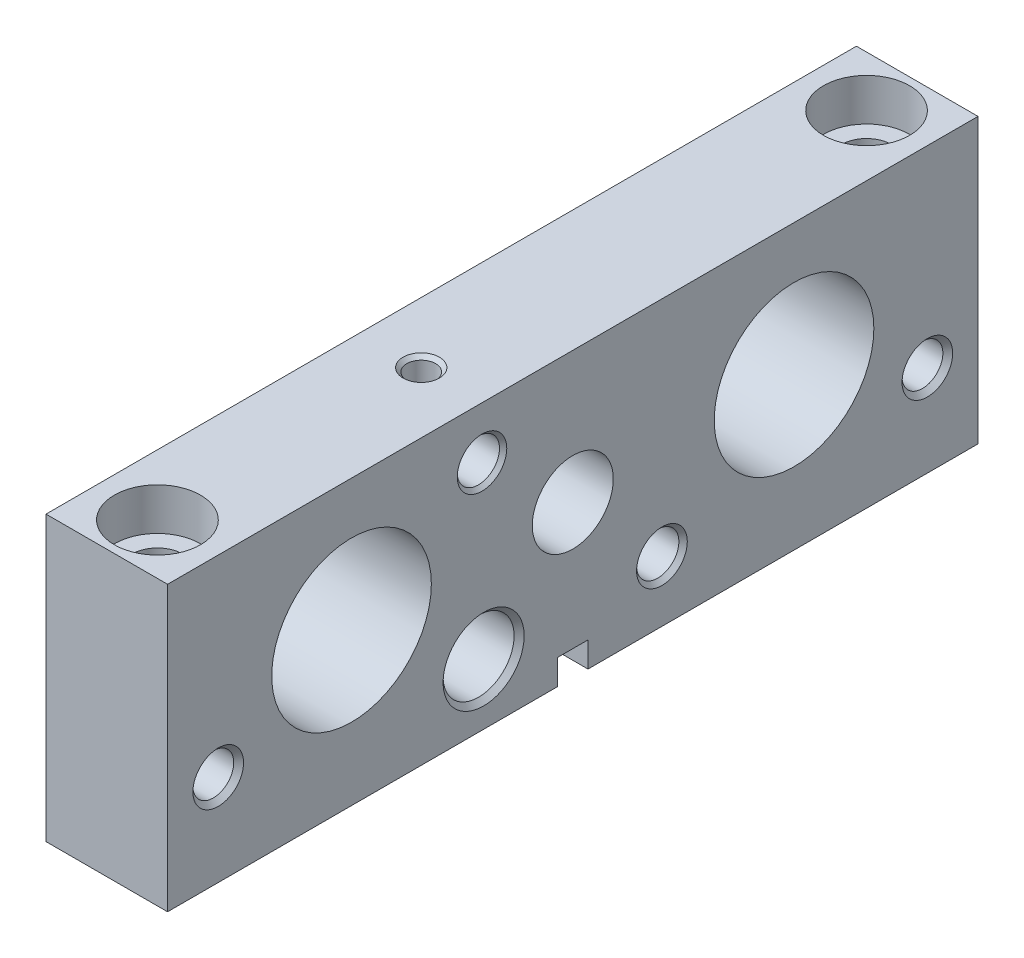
ISO-10303-21;
HEADER;
FILE_DESCRIPTION(('STEP AP214'),'2;1');
FILE_NAME('part.step','',(''),(''),'','','');
FILE_SCHEMA(('AUTOMOTIVE_DESIGN { 1 0 10303 214 1 1 1 1 }'));
ENDSEC;
DATA;
#1=APPLICATION_CONTEXT('core data for automotive mechanical design processes');
#2=APPLICATION_PROTOCOL_DEFINITION('international standard','automotive_design',2000,#1);
#3=PRODUCT_CONTEXT('',#1,'mechanical');
#4=PRODUCT('Part','Part','',(#3));
#5=PRODUCT_RELATED_PRODUCT_CATEGORY('part','',(#4));
#6=PRODUCT_DEFINITION_FORMATION('','',#4);
#7=PRODUCT_DEFINITION_CONTEXT('part definition',#1,'design');
#8=PRODUCT_DEFINITION('design','',#6,#7);
#9=PRODUCT_DEFINITION_SHAPE('','',#8);
#10=(LENGTH_UNIT() NAMED_UNIT(*) SI_UNIT(.MILLI.,.METRE.));
#11=(NAMED_UNIT(*) PLANE_ANGLE_UNIT() SI_UNIT($,.RADIAN.));
#12=(NAMED_UNIT(*) SI_UNIT($,.STERADIAN.) SOLID_ANGLE_UNIT());
#13=UNCERTAINTY_MEASURE_WITH_UNIT(LENGTH_MEASURE(1.E-05),#10,'distance_accuracy_value','');
#14=(GEOMETRIC_REPRESENTATION_CONTEXT(3) GLOBAL_UNCERTAINTY_ASSIGNED_CONTEXT((#13)) GLOBAL_UNIT_ASSIGNED_CONTEXT((#10,
#11,#12)) REPRESENTATION_CONTEXT('',''));
#15=CARTESIAN_POINT('',(0.,0.,0.));
#16=DIRECTION('',(0.,0.,1.));
#17=DIRECTION('',(1.,0.,0.));
#18=AXIS2_PLACEMENT_3D('',#15,#16,#17);
#19=CARTESIAN_POINT('',(19.05,-23.8252,63.5));
#20=DIRECTION('',(1.,0.,0.));
#21=DIRECTION('',(0.,0.,-1.));
#22=AXIS2_PLACEMENT_3D('',#19,#20,#21);
#23=PLANE('',#22);
#24=CARTESIAN_POINT('',(19.05,-9.525,-55.5625));
#25=DIRECTION('',(1.,0.,0.));
#26=DIRECTION('',(0.,0.,-1.));
#27=AXIS2_PLACEMENT_3D('',#24,#25,#26);
#28=CIRCLE('',#27,3.96875);
#29=CARTESIAN_POINT('',(19.05,-9.525,-59.53125));
#30=VERTEX_POINT('',#29);
#31=EDGE_CURVE('E644',#30,#30,#28,.T.);
#32=ORIENTED_EDGE('',*,*,#31,.F.);
#33=EDGE_LOOP('',(#32));
#34=FACE_BOUND('',#33,.T.);
#35=CARTESIAN_POINT('',(19.05,0.,-34.671));
#36=DIRECTION('',(1.,0.,0.));
#37=DIRECTION('',(0.,0.,-1.));
#38=AXIS2_PLACEMENT_3D('',#35,#36,#37);
#39=CIRCLE('',#38,12.5095);
#40=CARTESIAN_POINT('',(19.05,0.,-47.1805));
#41=VERTEX_POINT('',#40);
#42=EDGE_CURVE('E665',#41,#41,#39,.T.);
#43=ORIENTED_EDGE('',*,*,#42,.F.);
#44=EDGE_LOOP('',(#43));
#45=FACE_BOUND('',#44,.T.);
#46=CARTESIAN_POINT('',(19.05,12.4968,14.224));
#47=DIRECTION('',(1.,0.,0.));
#48=DIRECTION('',(0.,0.,-1.));
#49=AXIS2_PLACEMENT_3D('',#46,#47,#48);
#50=CIRCLE('',#49,3.88);
#51=CARTESIAN_POINT('',(19.05,12.4968,10.344));
#52=VERTEX_POINT('',#51);
#53=EDGE_CURVE('E323',#52,#52,#50,.T.);
#54=ORIENTED_EDGE('',*,*,#53,.F.);
#55=EDGE_LOOP('',(#54));
#56=FACE_BOUND('',#55,.T.);
#57=CARTESIAN_POINT('',(19.05,-14.3002,-13.97));
#58=DIRECTION('',(1.,0.,0.));
#59=DIRECTION('',(0.,0.,-1.));
#60=AXIS2_PLACEMENT_3D('',#57,#58,#59);
#61=CIRCLE('',#60,3.9751);
#62=CARTESIAN_POINT('',(19.05,-14.3002,-17.9451));
#63=VERTEX_POINT('',#62);
#64=EDGE_CURVE('E123',#63,#63,#61,.T.);
#65=ORIENTED_EDGE('',*,*,#64,.F.);
#66=EDGE_LOOP('',(#65));
#67=FACE_BOUND('',#66,.T.);
#68=DIRECTION('',(0.,-1.,0.));
#69=VECTOR('',#68,1.);
#70=CARTESIAN_POINT('',(19.05,20.6248,63.5));
#71=LINE('',#70,#69);
#72=CARTESIAN_POINT('',(19.05,20.6248,63.5));
#73=VERTEX_POINT('',#72);
#74=CARTESIAN_POINT('',(19.05,-23.8252,63.5));
#75=VERTEX_POINT('',#74);
#76=EDGE_CURVE('E366',#73,#75,#71,.T.);
#77=ORIENTED_EDGE('',*,*,#76,.T.);
#78=DIRECTION('',(0.,0.,-1.));
#79=VECTOR('',#78,1.);
#80=CARTESIAN_POINT('',(19.05,-23.8252,63.5));
#81=LINE('',#80,#79);
#82=CARTESIAN_POINT('',(19.05,-23.8252,2.38379));
#83=VERTEX_POINT('',#82);
#84=EDGE_CURVE('E368',#75,#83,#81,.T.);
#85=ORIENTED_EDGE('',*,*,#84,.T.);
#86=DIRECTION('',(0.,1.,0.));
#87=VECTOR('',#86,1.);
#88=CARTESIAN_POINT('',(19.05,-23.8252,2.38379));
#89=LINE('',#88,#87);
#90=CARTESIAN_POINT('',(19.05,-19.8628,2.38379));
#91=VERTEX_POINT('',#90);
#92=EDGE_CURVE('E370',#83,#91,#89,.T.);
#93=ORIENTED_EDGE('',*,*,#92,.T.);
#94=DIRECTION('',(0.,0.,-1.));
#95=VECTOR('',#94,1.);
#96=CARTESIAN_POINT('',(19.05,-19.8628,2.38379));
#97=LINE('',#96,#95);
#98=CARTESIAN_POINT('',(19.05,-19.8628,-2.38379));
#99=VERTEX_POINT('',#98);
#100=EDGE_CURVE('E137',#91,#99,#97,.T.);
#101=ORIENTED_EDGE('',*,*,#100,.T.);
#102=DIRECTION('',(0.,-1.,0.));
#103=VECTOR('',#102,1.);
#104=CARTESIAN_POINT('',(19.05,-19.8628,-2.38379));
#105=LINE('',#104,#103);
#106=CARTESIAN_POINT('',(19.05,-23.8252,-2.38379));
#107=VERTEX_POINT('',#106);
#108=EDGE_CURVE('E373',#99,#107,#105,.T.);
#109=ORIENTED_EDGE('',*,*,#108,.T.);
#110=DIRECTION('',(0.,0.,-1.));
#111=VECTOR('',#110,1.);
#112=CARTESIAN_POINT('',(19.05,-23.8252,-2.38379));
#113=LINE('',#112,#111);
#114=CARTESIAN_POINT('',(19.05,-23.8252,-63.5));
#115=VERTEX_POINT('',#114);
#116=EDGE_CURVE('E375',#107,#115,#113,.T.);
#117=ORIENTED_EDGE('',*,*,#116,.T.);
#118=DIRECTION('',(0.,1.,0.));
#119=VECTOR('',#118,1.);
#120=CARTESIAN_POINT('',(19.05,-23.8252,-63.5));
#121=LINE('',#120,#119);
#122=CARTESIAN_POINT('',(19.05,20.6248,-63.5));
#123=VERTEX_POINT('',#122);
#124=EDGE_CURVE('E377',#115,#123,#121,.T.);
#125=ORIENTED_EDGE('',*,*,#124,.T.);
#126=DIRECTION('',(0.,0.,1.));
#127=VECTOR('',#126,1.);
#128=CARTESIAN_POINT('',(19.05,20.6248,-63.5));
#129=LINE('',#128,#127);
#130=EDGE_CURVE('E60',#123,#73,#129,.T.);
#131=ORIENTED_EDGE('',*,*,#130,.T.);
#132=EDGE_LOOP('',(#77,#85,#93,#101,#109,#117,#125,#131));
#133=FACE_BOUND('',#132,.T.);
#134=CARTESIAN_POINT('',(19.05,-14.3002,13.97));
#135=DIRECTION('',(1.,0.,0.));
#136=DIRECTION('',(0.,0.,-1.));
#137=AXIS2_PLACEMENT_3D('',#134,#135,#136);
#138=CIRCLE('',#137,6.35);
#139=CARTESIAN_POINT('',(19.05,-14.3002,7.62));
#140=VERTEX_POINT('',#139);
#141=EDGE_CURVE('E335',#140,#140,#138,.T.);
#142=ORIENTED_EDGE('',*,*,#141,.F.);
#143=EDGE_LOOP('',(#142));
#144=FACE_BOUND('',#143,.T.);
#145=CARTESIAN_POINT('',(19.05,0.,34.671));
#146=DIRECTION('',(1.,0.,0.));
#147=DIRECTION('',(0.,0.,-1.));
#148=AXIS2_PLACEMENT_3D('',#145,#146,#147);
#149=CIRCLE('',#148,12.5095);
#150=CARTESIAN_POINT('',(19.05,0.,22.1615));
#151=VERTEX_POINT('',#150);
#152=EDGE_CURVE('E670',#151,#151,#149,.T.);
#153=ORIENTED_EDGE('',*,*,#152,.F.);
#154=EDGE_LOOP('',(#153));
#155=FACE_BOUND('',#154,.T.);
#156=CARTESIAN_POINT('',(19.05,0.,0.));
#157=DIRECTION('',(-1.,0.,0.));
#158=DIRECTION('',(0.,0.,1.));
#159=AXIS2_PLACEMENT_3D('',#156,#157,#158);
#160=CIRCLE('',#159,6.35);
#161=CARTESIAN_POINT('',(19.05,0.,6.35));
#162=VERTEX_POINT('',#161);
#163=EDGE_CURVE('E647',#162,#162,#160,.T.);
#164=ORIENTED_EDGE('',*,*,#163,.T.);
#165=EDGE_LOOP('',(#164));
#166=FACE_BOUND('',#165,.T.);
#167=CARTESIAN_POINT('',(19.05,-9.525,55.5625));
#168=DIRECTION('',(1.,0.,0.));
#169=DIRECTION('',(0.,0.,-1.));
#170=AXIS2_PLACEMENT_3D('',#167,#168,#169);
#171=CIRCLE('',#170,3.96875);
#172=CARTESIAN_POINT('',(19.05,-9.525,51.59375));
#173=VERTEX_POINT('',#172);
#174=EDGE_CURVE('E190',#173,#173,#171,.T.);
#175=ORIENTED_EDGE('',*,*,#174,.F.);
#176=EDGE_LOOP('',(#175));
#177=FACE_BOUND('',#176,.T.);
#178=ADVANCED_FACE('F32',(#34,#45,#56,#67,#133,#144,#155,#166,#177),#23,.T.);
#179=CARTESIAN_POINT('',(0.,-23.8252,63.5));
#180=DIRECTION('',(1.,0.,0.));
#181=DIRECTION('',(0.,0.,-1.));
#182=AXIS2_PLACEMENT_3D('',#179,#180,#181);
#183=PLANE('',#182);
#184=CARTESIAN_POINT('',(0.,-9.525,-55.5625));
#185=DIRECTION('',(1.,0.,0.));
#186=DIRECTION('',(0.,0.,-1.));
#187=AXIS2_PLACEMENT_3D('',#184,#185,#186);
#188=CIRCLE('',#187,3.96875);
#189=CARTESIAN_POINT('',(0.,-9.525,-59.53125));
#190=VERTEX_POINT('',#189);
#191=EDGE_CURVE('E635',#190,#190,#188,.T.);
#192=ORIENTED_EDGE('',*,*,#191,.T.);
#193=EDGE_LOOP('',(#192));
#194=FACE_BOUND('',#193,.T.);
#195=CARTESIAN_POINT('',(0.,0.,-34.671));
#196=DIRECTION('',(1.,0.,0.));
#197=DIRECTION('',(0.,0.,-1.));
#198=AXIS2_PLACEMENT_3D('',#195,#196,#197);
#199=CIRCLE('',#198,12.5095);
#200=CARTESIAN_POINT('',(0.,0.,-47.1805));
#201=VERTEX_POINT('',#200);
#202=EDGE_CURVE('E662',#201,#201,#199,.T.);
#203=ORIENTED_EDGE('',*,*,#202,.T.);
#204=EDGE_LOOP('',(#203));
#205=FACE_BOUND('',#204,.T.);
#206=CARTESIAN_POINT('',(0.,12.4968,14.224));
#207=DIRECTION('',(1.,0.,0.));
#208=DIRECTION('',(0.,0.,-1.));
#209=AXIS2_PLACEMENT_3D('',#206,#207,#208);
#210=CIRCLE('',#209,3.88);
#211=CARTESIAN_POINT('',(0.,12.4968,10.344));
#212=VERTEX_POINT('',#211);
#213=EDGE_CURVE('E314',#212,#212,#210,.T.);
#214=ORIENTED_EDGE('',*,*,#213,.T.);
#215=EDGE_LOOP('',(#214));
#216=FACE_BOUND('',#215,.T.);
#217=CARTESIAN_POINT('',(0.,-14.3002,-13.97));
#218=DIRECTION('',(1.,0.,0.));
#219=DIRECTION('',(0.,0.,-1.));
#220=AXIS2_PLACEMENT_3D('',#217,#218,#219);
#221=CIRCLE('',#220,3.9751);
#222=CARTESIAN_POINT('',(0.,-14.3002,-17.9451));
#223=VERTEX_POINT('',#222);
#224=EDGE_CURVE('E338',#223,#223,#221,.T.);
#225=ORIENTED_EDGE('',*,*,#224,.T.);
#226=EDGE_LOOP('',(#225));
#227=FACE_BOUND('',#226,.T.);
#228=DIRECTION('',(0.,-1.,0.));
#229=VECTOR('',#228,1.);
#230=CARTESIAN_POINT('',(0.,20.6248,63.5));
#231=LINE('',#230,#229);
#232=CARTESIAN_POINT('',(0.,20.6248,63.5));
#233=VERTEX_POINT('',#232);
#234=CARTESIAN_POINT('',(0.,-23.8252,63.5));
#235=VERTEX_POINT('',#234);
#236=EDGE_CURVE('E351',#233,#235,#231,.T.);
#237=ORIENTED_EDGE('',*,*,#236,.F.);
#238=DIRECTION('',(0.,0.,1.));
#239=VECTOR('',#238,1.);
#240=CARTESIAN_POINT('',(0.,20.6248,-63.5));
#241=LINE('',#240,#239);
#242=CARTESIAN_POINT('',(0.,20.6248,-63.5));
#243=VERTEX_POINT('',#242);
#244=EDGE_CURVE('E364',#243,#233,#241,.T.);
#245=ORIENTED_EDGE('',*,*,#244,.F.);
#246=DIRECTION('',(0.,1.,0.));
#247=VECTOR('',#246,1.);
#248=CARTESIAN_POINT('',(0.,-23.8252,-63.5));
#249=LINE('',#248,#247);
#250=CARTESIAN_POINT('',(0.,-23.8252,-63.5));
#251=VERTEX_POINT('',#250);
#252=EDGE_CURVE('E362',#251,#243,#249,.T.);
#253=ORIENTED_EDGE('',*,*,#252,.F.);
#254=DIRECTION('',(0.,0.,-1.));
#255=VECTOR('',#254,1.);
#256=CARTESIAN_POINT('',(0.,-23.8252,-2.38379));
#257=LINE('',#256,#255);
#258=CARTESIAN_POINT('',(0.,-23.8252,-2.38379));
#259=VERTEX_POINT('',#258);
#260=EDGE_CURVE('E360',#259,#251,#257,.T.);
#261=ORIENTED_EDGE('',*,*,#260,.F.);
#262=DIRECTION('',(0.,-1.,0.));
#263=VECTOR('',#262,1.);
#264=CARTESIAN_POINT('',(0.,-19.8628,-2.38379));
#265=LINE('',#264,#263);
#266=CARTESIAN_POINT('',(0.,-19.8628,-2.38379));
#267=VERTEX_POINT('',#266);
#268=EDGE_CURVE('E358',#267,#259,#265,.T.);
#269=ORIENTED_EDGE('',*,*,#268,.F.);
#270=DIRECTION('',(0.,0.,-1.));
#271=VECTOR('',#270,1.);
#272=CARTESIAN_POINT('',(0.,-19.8628,2.38379));
#273=LINE('',#272,#271);
#274=CARTESIAN_POINT('',(0.,-19.8628,2.38379));
#275=VERTEX_POINT('',#274);
#276=EDGE_CURVE('E356',#275,#267,#273,.T.);
#277=ORIENTED_EDGE('',*,*,#276,.F.);
#278=DIRECTION('',(0.,1.,0.));
#279=VECTOR('',#278,1.);
#280=CARTESIAN_POINT('',(0.,-23.8252,2.38379));
#281=LINE('',#280,#279);
#282=CARTESIAN_POINT('',(0.,-23.8252,2.38379));
#283=VERTEX_POINT('',#282);
#284=EDGE_CURVE('E132',#283,#275,#281,.T.);
#285=ORIENTED_EDGE('',*,*,#284,.F.);
#286=DIRECTION('',(0.,0.,-1.));
#287=VECTOR('',#286,1.);
#288=CARTESIAN_POINT('',(0.,-23.8252,63.5));
#289=LINE('',#288,#287);
#290=EDGE_CURVE('E285',#235,#283,#289,.T.);
#291=ORIENTED_EDGE('',*,*,#290,.F.);
#292=EDGE_LOOP('',(#237,#245,#253,#261,#269,#277,#285,#291));
#293=FACE_BOUND('',#292,.T.);
#294=CARTESIAN_POINT('',(0.,-14.3002,13.97));
#295=DIRECTION('',(1.,0.,0.));
#296=DIRECTION('',(0.,0.,-1.));
#297=AXIS2_PLACEMENT_3D('',#294,#295,#296);
#298=CIRCLE('',#297,6.35);
#299=CARTESIAN_POINT('',(0.,-14.3002,7.62));
#300=VERTEX_POINT('',#299);
#301=EDGE_CURVE('E326',#300,#300,#298,.T.);
#302=ORIENTED_EDGE('',*,*,#301,.T.);
#303=EDGE_LOOP('',(#302));
#304=FACE_BOUND('',#303,.T.);
#305=CARTESIAN_POINT('',(0.,0.,34.671));
#306=DIRECTION('',(1.,0.,0.));
#307=DIRECTION('',(0.,0.,-1.));
#308=AXIS2_PLACEMENT_3D('',#305,#306,#307);
#309=CIRCLE('',#308,12.5095);
#310=CARTESIAN_POINT('',(0.,0.,22.1615));
#311=VERTEX_POINT('',#310);
#312=EDGE_CURVE('E667',#311,#311,#309,.T.);
#313=ORIENTED_EDGE('',*,*,#312,.T.);
#314=EDGE_LOOP('',(#313));
#315=FACE_BOUND('',#314,.T.);
#316=CARTESIAN_POINT('',(0.,0.,0.));
#317=DIRECTION('',(-1.,0.,0.));
#318=DIRECTION('',(0.,0.,1.));
#319=AXIS2_PLACEMENT_3D('',#316,#317,#318);
#320=CIRCLE('',#319,5.1317658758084);
#321=CARTESIAN_POINT('',(0.,0.,5.1317658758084));
#322=VERTEX_POINT('',#321);
#323=EDGE_CURVE('E659',#322,#322,#320,.T.);
#324=ORIENTED_EDGE('',*,*,#323,.F.);
#325=EDGE_LOOP('',(#324));
#326=FACE_BOUND('',#325,.T.);
#327=CARTESIAN_POINT('',(0.,-9.525,55.5625));
#328=DIRECTION('',(1.,0.,0.));
#329=DIRECTION('',(0.,0.,-1.));
#330=AXIS2_PLACEMENT_3D('',#327,#328,#329);
#331=CIRCLE('',#330,3.96875);
#332=CARTESIAN_POINT('',(0.,-9.525,51.59375));
#333=VERTEX_POINT('',#332);
#334=EDGE_CURVE('E625',#333,#333,#331,.T.);
#335=ORIENTED_EDGE('',*,*,#334,.T.);
#336=EDGE_LOOP('',(#335));
#337=FACE_BOUND('',#336,.T.);
#338=ADVANCED_FACE('F182',(#194,#205,#216,#227,#293,#304,#315,#326,#337),#183,.F.);
#339=CARTESIAN_POINT('',(9.525,-23.8252,55.5625));
#340=DIRECTION('',(0.,1.,0.));
#341=DIRECTION('',(0.,0.,1.));
#342=AXIS2_PLACEMENT_3D('',#339,#340,#341);
#343=CYLINDRICAL_SURFACE('',#342,3.96875);
#344=CARTESIAN_POINT('',(11.8720015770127,-9.525,52.3621));
#345=CARTESIAN_POINT('',(11.872002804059,-9.46554218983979,52.3621004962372));
#346=CARTESIAN_POINT('',(11.8742741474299,-9.40606685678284,52.3637622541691));
#347=CARTESIAN_POINT('',(11.8832331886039,-9.287619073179,52.3703629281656));
#348=CARTESIAN_POINT('',(11.8899236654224,-9.22864696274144,52.3753039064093));
#349=CARTESIAN_POINT('',(11.9162136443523,-9.05292371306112,52.3949175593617));
#350=CARTESIAN_POINT('',(11.9420298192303,-8.93759348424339,52.4143803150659));
#351=CARTESIAN_POINT('',(12.0174690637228,-8.67328465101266,52.4735614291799));
#352=CARTESIAN_POINT('',(12.0722949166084,-8.52693807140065,52.5180234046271));
#353=CARTESIAN_POINT('',(12.1946694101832,-8.24643029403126,52.6247370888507));
#354=CARTESIAN_POINT('',(12.2622554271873,-8.11230665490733,52.6870413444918));
#355=CARTESIAN_POINT('',(12.3809692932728,-7.89603835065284,52.805847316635));
#356=CARTESIAN_POINT('',(12.4306639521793,-7.81071887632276,52.8581085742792));
#357=CARTESIAN_POINT('',(12.5309873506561,-7.64568188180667,52.9700730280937));
#358=CARTESIAN_POINT('',(12.581616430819,-7.5659664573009,53.0297789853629));
#359=CARTESIAN_POINT('',(12.7326084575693,-7.3355033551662,53.2197906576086));
#360=CARTESIAN_POINT('',(12.8322752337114,-7.1930972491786,53.3611785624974));
#361=CARTESIAN_POINT('',(13.0008678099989,-6.96019547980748,53.64142460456));
#362=CARTESIAN_POINT('',(13.0719528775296,-6.86501522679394,53.7751198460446));
#363=CARTESIAN_POINT('',(13.2016628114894,-6.69436022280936,54.0600043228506));
#364=CARTESIAN_POINT('',(13.260307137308,-6.61885465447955,54.211165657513));
#365=CARTESIAN_POINT('',(13.3521000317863,-6.50186342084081,54.5024779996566));
#366=CARTESIAN_POINT('',(13.3878513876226,-6.45683109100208,54.6403765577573));
#367=CARTESIAN_POINT('',(13.4446930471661,-6.38556612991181,54.9238837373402));
#368=CARTESIAN_POINT('',(13.4657914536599,-6.35932310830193,55.0694880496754));
#369=CARTESIAN_POINT('',(13.4916106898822,-6.32723890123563,55.3649340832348));
#370=CARTESIAN_POINT('',(13.4962726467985,-6.32147105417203,55.5147891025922));
#371=CARTESIAN_POINT('',(13.4886264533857,-6.33095455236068,55.8133919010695));
#372=CARTESIAN_POINT('',(13.4763177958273,-6.34620652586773,55.9621396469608));
#373=CARTESIAN_POINT('',(13.4369950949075,-6.39522586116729,56.2455802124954));
#374=CARTESIAN_POINT('',(13.4108564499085,-6.42789181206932,56.3805913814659));
#375=CARTESIAN_POINT('',(13.3463405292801,-6.50923491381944,56.6425711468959));
#376=CARTESIAN_POINT('',(13.307960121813,-6.5579161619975,56.7695376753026));
#377=CARTESIAN_POINT('',(13.2171685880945,-6.67453319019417,57.0250143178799));
#378=CARTESIAN_POINT('',(13.1637741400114,-6.74385403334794,57.1525359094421));
#379=CARTESIAN_POINT('',(13.0482693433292,-6.89678359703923,57.3943114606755));
#380=CARTESIAN_POINT('',(12.9861544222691,-6.98039981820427,57.5085584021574));
#381=CARTESIAN_POINT('',(12.8429048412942,-7.17857190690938,57.7454763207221));
#382=CARTESIAN_POINT('',(12.7604924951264,-7.29595059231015,57.865008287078));
#383=CARTESIAN_POINT('',(12.5930194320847,-7.5468416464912,58.0838536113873));
#384=CARTESIAN_POINT('',(12.5079553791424,-7.68037500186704,58.1831402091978));
#385=CARTESIAN_POINT('',(12.3484029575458,-7.95199364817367,58.3539020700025));
#386=CARTESIAN_POINT('',(12.2736070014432,-8.08891348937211,58.4269415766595));
#387=CARTESIAN_POINT('',(12.1349074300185,-8.37651469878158,58.5538444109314));
#388=CARTESIAN_POINT('',(12.0709802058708,-8.52716511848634,58.6077495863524));
#389=CARTESIAN_POINT('',(11.9817811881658,-8.79186589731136,58.679775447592));
#390=CARTESIAN_POINT('',(11.9506826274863,-8.9022891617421,58.7038252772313));
#391=CARTESIAN_POINT('',(11.9028077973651,-9.1279780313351,58.7402241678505));
#392=CARTESIAN_POINT('',(11.88599816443,-9.24323169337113,58.7526004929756));
#393=CARTESIAN_POINT('',(11.869612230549,-9.47646019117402,58.7646712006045));
#394=CARTESIAN_POINT('',(11.8701493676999,-9.59444789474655,58.7642821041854));
#395=CARTESIAN_POINT('',(11.8886340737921,-9.82834705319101,58.7506525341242));
#396=CARTESIAN_POINT('',(11.9066049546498,-9.94425551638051,58.7373948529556));
#397=CARTESIAN_POINT('',(11.9626588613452,-10.1976929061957,58.6946364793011));
#398=CARTESIAN_POINT('',(12.0045014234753,-10.3338286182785,58.662028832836));
#399=CARTESIAN_POINT('',(12.1020461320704,-10.5963331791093,58.5814050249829));
#400=CARTESIAN_POINT('',(12.1577902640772,-10.7226708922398,58.5333420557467));
#401=CARTESIAN_POINT('',(12.2613813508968,-10.9340727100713,58.4377094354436));
#402=CARTESIAN_POINT('',(12.3075653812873,-11.0213874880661,58.3931999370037));
#403=CARTESIAN_POINT('',(12.4021753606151,-11.1907319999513,58.2969811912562));
#404=CARTESIAN_POINT('',(12.4506022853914,-11.2727593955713,58.2452687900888));
#405=CARTESIAN_POINT('',(12.5481849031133,-11.4316083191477,58.1348084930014));
#406=CARTESIAN_POINT('',(12.5973412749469,-11.5084245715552,58.0760536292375));
#407=CARTESIAN_POINT('',(12.6950563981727,-11.6566529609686,57.9516372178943));
#408=CARTESIAN_POINT('',(12.7436151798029,-11.7280653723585,57.8859760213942));
#409=CARTESIAN_POINT('',(12.8398469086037,-11.8664326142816,57.7465489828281));
#410=CARTESIAN_POINT('',(12.8874883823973,-11.933284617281,57.6726589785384));
#411=CARTESIAN_POINT('',(12.979823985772,-12.0606088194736,57.5178247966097));
#412=CARTESIAN_POINT('',(13.024517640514,-12.1210799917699,57.4368794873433));
#413=CARTESIAN_POINT('',(13.1096891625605,-12.2347960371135,57.2683328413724));
#414=CARTESIAN_POINT('',(13.1501781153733,-12.2880600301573,57.1807501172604));
#415=CARTESIAN_POINT('',(13.2258986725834,-12.3866831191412,56.9991647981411));
#416=CARTESIAN_POINT('',(13.2611331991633,-12.432046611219,56.9051658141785));
#417=CARTESIAN_POINT('',(13.3367217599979,-12.5286671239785,56.676479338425));
#418=CARTESIAN_POINT('',(13.3743889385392,-12.5762149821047,56.5392777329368));
#419=CARTESIAN_POINT('',(13.4352259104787,-12.6526163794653,56.2567350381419));
#420=CARTESIAN_POINT('',(13.4584068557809,-12.6814842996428,56.1114003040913));
#421=CARTESIAN_POINT('',(13.4884514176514,-12.7188467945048,55.8158065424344));
#422=CARTESIAN_POINT('',(13.4952482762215,-12.7272580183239,55.6655298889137));
#423=CARTESIAN_POINT('',(13.4916953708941,-12.7228520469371,55.3654924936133));
#424=CARTESIAN_POINT('',(13.4813454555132,-12.7100346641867,55.2157317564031));
#425=CARTESIAN_POINT('',(13.4455856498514,-12.6654992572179,54.9305240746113));
#426=CARTESIAN_POINT('',(13.4211358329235,-12.6349855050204,54.794761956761));
#427=CARTESIAN_POINT('',(13.3597428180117,-12.557719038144,54.5309544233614));
#428=CARTESIAN_POINT('',(13.3227963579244,-12.5109620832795,54.4029110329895));
#429=CARTESIAN_POINT('',(13.2351040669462,-12.3986379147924,54.1461501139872));
#430=CARTESIAN_POINT('',(13.1834524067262,-12.331809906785,54.0182998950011));
#431=CARTESIAN_POINT('',(13.0712107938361,-12.1838562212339,53.7755239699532));
#432=CARTESIAN_POINT('',(13.0106168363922,-12.1027241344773,53.660604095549));
#433=CARTESIAN_POINT('',(12.8706661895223,-11.9104323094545,53.4223522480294));
#434=CARTESIAN_POINT('',(12.7899936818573,-11.796518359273,53.3020220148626));
#435=CARTESIAN_POINT('',(12.6253665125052,-11.5528007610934,53.0810273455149));
#436=CARTESIAN_POINT('',(12.5414072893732,-11.4229744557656,52.9803914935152));
#437=CARTESIAN_POINT('',(12.3790839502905,-11.152505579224,52.802206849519));
#438=CARTESIAN_POINT('',(12.3006268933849,-11.0123327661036,52.7240304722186));
#439=CARTESIAN_POINT('',(12.1543385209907,-10.7172167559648,52.5880309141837));
#440=CARTESIAN_POINT('',(12.0864871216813,-10.5623023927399,52.5301689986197));
#441=CARTESIAN_POINT('',(11.9915104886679,-10.2903546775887,52.4528717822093));
#442=CARTESIAN_POINT('',(11.9583120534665,-10.1772967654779,52.4270605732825));
#443=CARTESIAN_POINT('',(11.90681604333,-9.94591997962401,52.3877534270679));
#444=CARTESIAN_POINT('',(11.8884608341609,-9.82762335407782,52.3742098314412));
#445=CARTESIAN_POINT('',(11.8767781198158,-9.67792700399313,52.365608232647));
#446=CARTESIAN_POINT('',(11.8749911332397,-9.647390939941,52.3642944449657));
#447=CARTESIAN_POINT('',(11.8726024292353,-9.58623814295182,52.3625401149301));
#448=CARTESIAN_POINT('',(11.872000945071,-9.55562139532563,52.3620997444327));
#449=CARTESIAN_POINT('',(11.8720015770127,-9.525,52.3621));
#450=B_SPLINE_CURVE_WITH_KNOTS('',3,(#344,#345,#346,#347,#348,#349,#350,#351,#352,#353,#354,
#355,#356,#357,#358,#359,#360,#361,#362,#363,#364,#365,#366,#367,#368,#369,#370,#371,#372,#373,
#374,#375,#376,#377,#378,#379,#380,#381,#382,#383,#384,#385,#386,#387,#388,#389,#390,#391,#392,
#393,#394,#395,#396,#397,#398,#399,#400,#401,#402,#403,#404,#405,#406,#407,#408,#409,#410,#411,
#412,#413,#414,#415,#416,#417,#418,#419,#420,#421,#422,#423,#424,#425,#426,#427,#428,#429,#430,
#431,#432,#433,#434,#435,#436,#437,#438,#439,#440,#441,#442,#443,#444,#445,#446,#447,#448,#449),
.UNSPECIFIED.,.T.,.F.,(4,2,2,2,2,2,2,2,2,2,2,2,2,2,2,2,2,2,2,2,2,2,2,2,2,2,2,2,2,2,2,2,2,2,2,2,
2,2,2,2,2,2,2,2,2,2,2,2,2,2,2,2,4),(0.,0.178335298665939,0.356782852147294,0.714351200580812,
1.19917222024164,1.68543602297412,2.02019289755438,2.35507429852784,3.02353847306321,
3.55814494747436,4.09190894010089,4.53823939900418,4.98432284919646,5.43200248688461,
5.8796955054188,6.30194783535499,6.72430827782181,7.18659210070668,7.64911922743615,
8.20723963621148,8.76609304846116,9.28140034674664,9.795573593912,10.1459662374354,
10.4955384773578,10.8473971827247,11.1997270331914,11.6356309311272,12.0728676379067,
12.397510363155,12.7222956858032,13.0474050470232,13.3724978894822,13.7034171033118,
14.0343894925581,14.3644658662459,14.6943579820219,15.1424144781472,15.5901256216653,
16.0396579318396,16.4891942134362,16.9112288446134,17.333373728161,17.7913908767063,
18.2496137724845,18.8005397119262,19.352259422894,19.8865934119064,20.4199029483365,
20.7805346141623,21.139759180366,21.231585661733,21.3234302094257),.UNSPECIFIED.);
#451=CARTESIAN_POINT('',(11.8720015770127,-9.525,52.3621));
#452=VERTEX_POINT('',#451);
#453=EDGE_CURVE('E186',#452,#452,#450,.T.);
#454=ORIENTED_EDGE('',*,*,#453,.T.);
#455=EDGE_LOOP('',(#454));
#456=FACE_BOUND('',#455,.T.);
#457=CARTESIAN_POINT('',(9.525,14.0208,55.5625));
#458=DIRECTION('',(0.,1.,0.));
#459=DIRECTION('',(0.,0.,1.));
#460=AXIS2_PLACEMENT_3D('',#457,#458,#459);
#461=CIRCLE('',#460,3.96875);
#462=CARTESIAN_POINT('',(9.525,14.0208,59.53125));
#463=VERTEX_POINT('',#462);
#464=EDGE_CURVE('E289',#463,#463,#461,.T.);
#465=ORIENTED_EDGE('',*,*,#464,.T.);
#466=EDGE_LOOP('',(#465));
#467=FACE_BOUND('',#466,.T.);
#468=CARTESIAN_POINT('',(9.525,-23.8252,55.5625));
#469=DIRECTION('',(0.,1.,0.));
#470=DIRECTION('',(0.,0.,1.));
#471=AXIS2_PLACEMENT_3D('',#468,#469,#470);
#472=CIRCLE('',#471,3.96875);
#473=CARTESIAN_POINT('',(9.525,-23.8252,59.53125));
#474=VERTEX_POINT('',#473);
#475=EDGE_CURVE('E149',#474,#474,#472,.T.);
#476=ORIENTED_EDGE('',*,*,#475,.F.);
#477=EDGE_LOOP('',(#476));
#478=FACE_BOUND('',#477,.T.);
#479=CARTESIAN_POINT('',(7.17799842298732,-9.525,52.3621));
#480=CARTESIAN_POINT('',(7.17799719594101,-9.58445781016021,52.3621004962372));
#481=CARTESIAN_POINT('',(7.17572585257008,-9.64393314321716,52.3637622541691));
#482=CARTESIAN_POINT('',(7.16676681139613,-9.762380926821,52.3703629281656));
#483=CARTESIAN_POINT('',(7.1600763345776,-9.82135303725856,52.3753039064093));
#484=CARTESIAN_POINT('',(7.13378635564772,-9.99707628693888,52.3949175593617));
#485=CARTESIAN_POINT('',(7.10797018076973,-10.1124065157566,52.4143803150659));
#486=CARTESIAN_POINT('',(7.03253093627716,-10.3767153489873,52.4735614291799));
#487=CARTESIAN_POINT('',(6.97770508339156,-10.5230619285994,52.5180234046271));
#488=CARTESIAN_POINT('',(6.85533058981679,-10.8035697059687,52.6247370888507));
#489=CARTESIAN_POINT('',(6.78774457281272,-10.9376933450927,52.6870413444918));
#490=CARTESIAN_POINT('',(6.66903070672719,-11.1539616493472,52.805847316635));
#491=CARTESIAN_POINT('',(6.61933604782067,-11.2392811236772,52.8581085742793));
#492=CARTESIAN_POINT('',(6.51901264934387,-11.4043181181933,52.9700730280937));
#493=CARTESIAN_POINT('',(6.468383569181,-11.4840335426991,53.0297789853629));
#494=CARTESIAN_POINT('',(6.31739154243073,-11.7144966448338,53.2197906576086));
#495=CARTESIAN_POINT('',(6.21772476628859,-11.8569027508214,53.3611785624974));
#496=CARTESIAN_POINT('',(6.0491321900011,-12.0898045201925,53.64142460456));
#497=CARTESIAN_POINT('',(5.97804712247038,-12.1849847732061,53.7751198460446));
#498=CARTESIAN_POINT('',(5.84833718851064,-12.3556397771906,54.0600043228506));
#499=CARTESIAN_POINT('',(5.78969286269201,-12.4311453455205,54.211165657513));
#500=CARTESIAN_POINT('',(5.69789996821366,-12.5481365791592,54.5024779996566));
#501=CARTESIAN_POINT('',(5.66214861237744,-12.5931689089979,54.6403765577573));
#502=CARTESIAN_POINT('',(5.60530695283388,-12.6644338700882,54.9238837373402));
#503=CARTESIAN_POINT('',(5.5842085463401,-12.6906768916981,55.0694880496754));
#504=CARTESIAN_POINT('',(5.5583893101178,-12.7227610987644,55.3649340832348));
#505=CARTESIAN_POINT('',(5.55372735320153,-12.728528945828,55.5147891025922));
#506=CARTESIAN_POINT('',(5.5613735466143,-12.7190454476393,55.8133919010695));
#507=CARTESIAN_POINT('',(5.57368220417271,-12.7037934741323,55.9621396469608));
#508=CARTESIAN_POINT('',(5.6130049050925,-12.6547741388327,56.2455802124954));
#509=CARTESIAN_POINT('',(5.63914355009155,-12.6221081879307,56.3805913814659));
#510=CARTESIAN_POINT('',(5.70365947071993,-12.5407650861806,56.6425711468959));
#511=CARTESIAN_POINT('',(5.74203987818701,-12.4920838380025,56.7695376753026));
#512=CARTESIAN_POINT('',(5.83283141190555,-12.3754668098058,57.0250143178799));
#513=CARTESIAN_POINT('',(5.88622585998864,-12.3061459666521,57.1525359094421));
#514=CARTESIAN_POINT('',(6.00173065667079,-12.1532164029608,57.3943114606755));
#515=CARTESIAN_POINT('',(6.06384557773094,-12.0696001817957,57.5085584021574));
#516=CARTESIAN_POINT('',(6.2070951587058,-11.8714280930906,57.7454763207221));
#517=CARTESIAN_POINT('',(6.28950750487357,-11.7540494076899,57.865008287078));
#518=CARTESIAN_POINT('',(6.4569805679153,-11.5031583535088,58.0838536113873));
#519=CARTESIAN_POINT('',(6.54204462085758,-11.369624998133,58.1831402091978));
#520=CARTESIAN_POINT('',(6.70159704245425,-11.0980063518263,58.3539020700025));
#521=CARTESIAN_POINT('',(6.77639299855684,-10.9610865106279,58.4269415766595));
#522=CARTESIAN_POINT('',(6.91509256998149,-10.6734853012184,58.5538444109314));
#523=CARTESIAN_POINT('',(6.97901979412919,-10.5228348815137,58.6077495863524));
#524=CARTESIAN_POINT('',(7.06821881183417,-10.2581341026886,58.679775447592));
#525=CARTESIAN_POINT('',(7.09931737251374,-10.1477108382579,58.7038252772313));
#526=CARTESIAN_POINT('',(7.14719220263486,-9.92202196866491,58.7402241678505));
#527=CARTESIAN_POINT('',(7.16400183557,-9.80676830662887,58.7526004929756));
#528=CARTESIAN_POINT('',(7.18038776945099,-9.57353980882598,58.7646712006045));
#529=CARTESIAN_POINT('',(7.17985063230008,-9.45555210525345,58.7642821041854));
#530=CARTESIAN_POINT('',(7.16136592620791,-9.22165294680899,58.7506525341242));
#531=CARTESIAN_POINT('',(7.14339504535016,-9.10574448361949,58.7373948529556));
#532=CARTESIAN_POINT('',(7.08734113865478,-8.85230709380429,58.6946364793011));
#533=CARTESIAN_POINT('',(7.04549857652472,-8.71617138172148,58.662028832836));
#534=CARTESIAN_POINT('',(6.94795386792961,-8.45366682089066,58.5814050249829));
#535=CARTESIAN_POINT('',(6.8922097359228,-8.32732910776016,58.5333420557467));
#536=CARTESIAN_POINT('',(6.78861864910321,-8.11592728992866,58.4377094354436));
#537=CARTESIAN_POINT('',(6.74243461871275,-8.0286125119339,58.3931999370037));
#538=CARTESIAN_POINT('',(6.6478246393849,-7.85926800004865,58.2969811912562));
#539=CARTESIAN_POINT('',(6.59939771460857,-7.77724060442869,58.2452687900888));
#540=CARTESIAN_POINT('',(6.50181509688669,-7.61839168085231,58.1348084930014));
#541=CARTESIAN_POINT('',(6.45265872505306,-7.5415754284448,58.0760536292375));
#542=CARTESIAN_POINT('',(6.35494360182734,-7.39334703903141,57.9516372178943));
#543=CARTESIAN_POINT('',(6.30638482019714,-7.32193462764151,57.8859760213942));
#544=CARTESIAN_POINT('',(6.21015309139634,-7.18356738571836,57.7465489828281));
#545=CARTESIAN_POINT('',(6.16251161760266,-7.11671538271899,57.6726589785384));
#546=CARTESIAN_POINT('',(6.07017601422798,-6.98939118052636,57.5178247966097));
#547=CARTESIAN_POINT('',(6.02548235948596,-6.92892000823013,57.4368794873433));
#548=CARTESIAN_POINT('',(5.94031083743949,-6.81520396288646,57.2683328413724));
#549=CARTESIAN_POINT('',(5.89982188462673,-6.76193996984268,57.1807501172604));
#550=CARTESIAN_POINT('',(5.82410132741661,-6.66331688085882,56.9991647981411));
#551=CARTESIAN_POINT('',(5.78886680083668,-6.617953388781,56.9051658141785));
#552=CARTESIAN_POINT('',(5.71327824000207,-6.52133287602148,56.676479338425));
#553=CARTESIAN_POINT('',(5.67561106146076,-6.47378501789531,56.5392777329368));
#554=CARTESIAN_POINT('',(5.61477408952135,-6.39738362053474,56.2567350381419));
#555=CARTESIAN_POINT('',(5.59159314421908,-6.36851570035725,56.1114003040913));
#556=CARTESIAN_POINT('',(5.56154858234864,-6.33115320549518,55.8158065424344));
#557=CARTESIAN_POINT('',(5.55475172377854,-6.32274198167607,55.6655298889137));
#558=CARTESIAN_POINT('',(5.55830462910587,-6.32714795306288,55.3654924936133));
#559=CARTESIAN_POINT('',(5.56865454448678,-6.33996533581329,55.2157317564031));
#560=CARTESIAN_POINT('',(5.60441435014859,-6.38450074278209,54.9305240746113));
#561=CARTESIAN_POINT('',(5.62886416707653,-6.41501449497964,54.794761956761));
#562=CARTESIAN_POINT('',(5.69025718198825,-6.49228096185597,54.5309544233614));
#563=CARTESIAN_POINT('',(5.72720364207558,-6.53903791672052,54.4029110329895));
#564=CARTESIAN_POINT('',(5.81489593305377,-6.65136208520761,54.1461501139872));
#565=CARTESIAN_POINT('',(5.86654759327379,-6.71819009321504,54.0182998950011));
#566=CARTESIAN_POINT('',(5.97878920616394,-6.86614377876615,53.7755239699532));
#567=CARTESIAN_POINT('',(6.03938316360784,-6.94727586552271,53.660604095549));
#568=CARTESIAN_POINT('',(6.17933381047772,-7.13956769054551,53.4223522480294));
#569=CARTESIAN_POINT('',(6.26000631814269,-7.25348164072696,53.3020220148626));
#570=CARTESIAN_POINT('',(6.42463348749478,-7.49719923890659,53.0810273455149));
#571=CARTESIAN_POINT('',(6.50859271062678,-7.62702554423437,52.9803914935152));
#572=CARTESIAN_POINT('',(6.67091604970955,-7.89749442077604,52.802206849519));
#573=CARTESIAN_POINT('',(6.7493731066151,-8.03766723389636,52.7240304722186));
#574=CARTESIAN_POINT('',(6.89566147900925,-8.33278324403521,52.5880309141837));
#575=CARTESIAN_POINT('',(6.96351287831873,-8.48769760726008,52.5301689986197));
#576=CARTESIAN_POINT('',(7.05848951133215,-8.7596453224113,52.4528717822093));
#577=CARTESIAN_POINT('',(7.09168794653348,-8.87270323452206,52.4270605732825));
#578=CARTESIAN_POINT('',(7.14318395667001,-9.10408002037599,52.3877534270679));
#579=CARTESIAN_POINT('',(7.1615391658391,-9.22237664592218,52.3742098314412));
#580=CARTESIAN_POINT('',(7.17322188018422,-9.37207299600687,52.365608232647));
#581=CARTESIAN_POINT('',(7.17500886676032,-9.402609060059,52.3642944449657));
#582=CARTESIAN_POINT('',(7.17739757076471,-9.46376185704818,52.3625401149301));
#583=CARTESIAN_POINT('',(7.17799905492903,-9.49437860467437,52.3620997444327));
#584=CARTESIAN_POINT('',(7.17799842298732,-9.525,52.3621));
#585=B_SPLINE_CURVE_WITH_KNOTS('',3,(#479,#480,#481,#482,#483,#484,#485,#486,#487,#488,#489,
#490,#491,#492,#493,#494,#495,#496,#497,#498,#499,#500,#501,#502,#503,#504,#505,#506,#507,#508,
#509,#510,#511,#512,#513,#514,#515,#516,#517,#518,#519,#520,#521,#522,#523,#524,#525,#526,#527,
#528,#529,#530,#531,#532,#533,#534,#535,#536,#537,#538,#539,#540,#541,#542,#543,#544,#545,#546,
#547,#548,#549,#550,#551,#552,#553,#554,#555,#556,#557,#558,#559,#560,#561,#562,#563,#564,#565,
#566,#567,#568,#569,#570,#571,#572,#573,#574,#575,#576,#577,#578,#579,#580,#581,#582,#583,#584),
.UNSPECIFIED.,.T.,.F.,(4,2,2,2,2,2,2,2,2,2,2,2,2,2,2,2,2,2,2,2,2,2,2,2,2,2,2,2,2,2,2,2,2,2,2,2,
2,2,2,2,2,2,2,2,2,2,2,2,2,2,2,2,4),(0.,0.178335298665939,0.356782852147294,0.714351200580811,
1.19917222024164,1.68543602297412,2.02019289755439,2.35507429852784,3.02353847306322,
3.55814494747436,4.09190894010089,4.53823939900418,4.98432284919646,5.43200248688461,
5.8796955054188,6.30194783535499,6.72430827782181,7.18659210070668,7.64911922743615,
8.20723963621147,8.76609304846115,9.28140034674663,9.795573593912,10.1459662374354,
10.4955384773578,10.8473971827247,11.1997270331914,11.6356309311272,12.0728676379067,
12.397510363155,12.7222956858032,13.0474050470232,13.3724978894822,13.7034171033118,
14.0343894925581,14.3644658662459,14.6943579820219,15.1424144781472,15.5901256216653,
16.0396579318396,16.4891942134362,16.9112288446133,17.333373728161,17.7913908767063,
18.2496137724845,18.8005397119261,19.352259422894,19.8865934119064,20.4199029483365,
20.7805346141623,21.139759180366,21.231585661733,21.3234302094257),.UNSPECIFIED.);
#586=CARTESIAN_POINT('',(7.17799842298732,-9.525,52.3621));
#587=VERTEX_POINT('',#586);
#588=EDGE_CURVE('E36',#587,#587,#585,.T.);
#589=ORIENTED_EDGE('',*,*,#588,.T.);
#590=EDGE_LOOP('',(#589));
#591=FACE_BOUND('',#590,.T.);
#592=ADVANCED_FACE('F177',(#456,#467,#478,#591),#343,.F.);
#593=CARTESIAN_POINT('',(9.525,-23.8252,-55.5625));
#594=DIRECTION('',(0.,1.,0.));
#595=DIRECTION('',(0.,0.,1.));
#596=AXIS2_PLACEMENT_3D('',#593,#594,#595);
#597=CYLINDRICAL_SURFACE('',#596,3.96875);
#598=CARTESIAN_POINT('',(11.8720015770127,-9.525,-58.7629));
#599=CARTESIAN_POINT('',(11.872002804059,-9.46554218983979,-58.7628995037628));
#600=CARTESIAN_POINT('',(11.8742741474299,-9.40606685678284,-58.7612377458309));
#601=CARTESIAN_POINT('',(11.8832331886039,-9.287619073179,-58.7546370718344));
#602=CARTESIAN_POINT('',(11.8899236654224,-9.22864696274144,-58.7496960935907));
#603=CARTESIAN_POINT('',(11.9162136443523,-9.05292371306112,-58.7300824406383));
#604=CARTESIAN_POINT('',(11.9420298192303,-8.93759348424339,-58.7106196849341));
#605=CARTESIAN_POINT('',(12.0174690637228,-8.67328465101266,-58.6514385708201));
#606=CARTESIAN_POINT('',(12.0722949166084,-8.52693807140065,-58.6069765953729));
#607=CARTESIAN_POINT('',(12.1946694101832,-8.24643029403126,-58.5002629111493));
#608=CARTESIAN_POINT('',(12.2622554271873,-8.11230665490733,-58.4379586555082));
#609=CARTESIAN_POINT('',(12.3809692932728,-7.89603835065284,-58.319152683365));
#610=CARTESIAN_POINT('',(12.4306639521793,-7.81071887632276,-58.2668914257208));
#611=CARTESIAN_POINT('',(12.5309873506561,-7.64568188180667,-58.1549269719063));
#612=CARTESIAN_POINT('',(12.581616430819,-7.56596645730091,-58.0952210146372));
#613=CARTESIAN_POINT('',(12.7326084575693,-7.3355033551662,-57.9052093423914));
#614=CARTESIAN_POINT('',(12.8322752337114,-7.1930972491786,-57.7638214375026));
#615=CARTESIAN_POINT('',(13.0008678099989,-6.96019547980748,-57.48357539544));
#616=CARTESIAN_POINT('',(13.0719528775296,-6.86501522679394,-57.3498801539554));
#617=CARTESIAN_POINT('',(13.2016628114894,-6.69436022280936,-57.0649956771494));
#618=CARTESIAN_POINT('',(13.260307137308,-6.61885465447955,-56.913834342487));
#619=CARTESIAN_POINT('',(13.3521000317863,-6.50186342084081,-56.6225220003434));
#620=CARTESIAN_POINT('',(13.3878513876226,-6.45683109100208,-56.4846234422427));
#621=CARTESIAN_POINT('',(13.4446930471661,-6.38556612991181,-56.2011162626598));
#622=CARTESIAN_POINT('',(13.4657914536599,-6.35932310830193,-56.0555119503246));
#623=CARTESIAN_POINT('',(13.4916106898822,-6.32723890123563,-55.7600659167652));
#624=CARTESIAN_POINT('',(13.4962726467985,-6.32147105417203,-55.6102108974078));
#625=CARTESIAN_POINT('',(13.4886264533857,-6.33095455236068,-55.3116080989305));
#626=CARTESIAN_POINT('',(13.4763177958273,-6.34620652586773,-55.1628603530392));
#627=CARTESIAN_POINT('',(13.4369950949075,-6.39522586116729,-54.8794197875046));
#628=CARTESIAN_POINT('',(13.4108564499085,-6.42789181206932,-54.7444086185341));
#629=CARTESIAN_POINT('',(13.3463405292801,-6.50923491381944,-54.4824288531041));
#630=CARTESIAN_POINT('',(13.307960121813,-6.5579161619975,-54.3554623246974));
#631=CARTESIAN_POINT('',(13.2171685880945,-6.67453319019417,-54.0999856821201));
#632=CARTESIAN_POINT('',(13.1637741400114,-6.74385403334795,-53.9724640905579));
#633=CARTESIAN_POINT('',(13.0482693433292,-6.89678359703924,-53.7306885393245));
#634=CARTESIAN_POINT('',(12.9861544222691,-6.98039981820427,-53.6164415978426));
#635=CARTESIAN_POINT('',(12.8429048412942,-7.17857190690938,-53.3795236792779));
#636=CARTESIAN_POINT('',(12.7604924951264,-7.29595059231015,-53.259991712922));
#637=CARTESIAN_POINT('',(12.5930194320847,-7.5468416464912,-53.0411463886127));
#638=CARTESIAN_POINT('',(12.5079553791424,-7.68037500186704,-52.9418597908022));
#639=CARTESIAN_POINT('',(12.3484029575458,-7.95199364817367,-52.7710979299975));
#640=CARTESIAN_POINT('',(12.2736070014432,-8.0889134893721,-52.6980584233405));
#641=CARTESIAN_POINT('',(12.1349074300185,-8.37651469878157,-52.5711555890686));
#642=CARTESIAN_POINT('',(12.0709802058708,-8.52716511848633,-52.5172504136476));
#643=CARTESIAN_POINT('',(11.9817811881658,-8.79186589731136,-52.445224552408));
#644=CARTESIAN_POINT('',(11.9506826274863,-8.9022891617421,-52.4211747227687));
#645=CARTESIAN_POINT('',(11.9028077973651,-9.1279780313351,-52.3847758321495));
#646=CARTESIAN_POINT('',(11.88599816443,-9.24323169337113,-52.3723995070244));
#647=CARTESIAN_POINT('',(11.869612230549,-9.47646019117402,-52.3603287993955));
#648=CARTESIAN_POINT('',(11.8701493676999,-9.59444789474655,-52.3607178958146));
#649=CARTESIAN_POINT('',(11.8886340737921,-9.82834705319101,-52.3743474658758));
#650=CARTESIAN_POINT('',(11.9066049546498,-9.94425551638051,-52.3876051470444));
#651=CARTESIAN_POINT('',(11.9626588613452,-10.1976929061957,-52.4303635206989));
#652=CARTESIAN_POINT('',(12.0045014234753,-10.3338286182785,-52.462971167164));
#653=CARTESIAN_POINT('',(12.1020461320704,-10.5963331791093,-52.5435949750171));
#654=CARTESIAN_POINT('',(12.1577902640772,-10.7226708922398,-52.5916579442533));
#655=CARTESIAN_POINT('',(12.2613813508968,-10.9340727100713,-52.6872905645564));
#656=CARTESIAN_POINT('',(12.3075653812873,-11.0213874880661,-52.7318000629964));
#657=CARTESIAN_POINT('',(12.4021753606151,-11.1907319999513,-52.8280188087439));
#658=CARTESIAN_POINT('',(12.4506022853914,-11.2727593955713,-52.8797312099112));
#659=CARTESIAN_POINT('',(12.5481849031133,-11.4316083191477,-52.9901915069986));
#660=CARTESIAN_POINT('',(12.5973412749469,-11.5084245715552,-53.0489463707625));
#661=CARTESIAN_POINT('',(12.6950563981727,-11.6566529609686,-53.1733627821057));
#662=CARTESIAN_POINT('',(12.7436151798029,-11.7280653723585,-53.2390239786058));
#663=CARTESIAN_POINT('',(12.8398469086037,-11.8664326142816,-53.3784510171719));
#664=CARTESIAN_POINT('',(12.8874883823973,-11.933284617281,-53.4523410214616));
#665=CARTESIAN_POINT('',(12.979823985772,-12.0606088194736,-53.6071752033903));
#666=CARTESIAN_POINT('',(13.024517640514,-12.1210799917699,-53.6881205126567));
#667=CARTESIAN_POINT('',(13.1096891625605,-12.2347960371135,-53.8566671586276));
#668=CARTESIAN_POINT('',(13.1501781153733,-12.2880600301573,-53.9442498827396));
#669=CARTESIAN_POINT('',(13.2258986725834,-12.3866831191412,-54.1258352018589));
#670=CARTESIAN_POINT('',(13.2611331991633,-12.432046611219,-54.2198341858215));
#671=CARTESIAN_POINT('',(13.3367217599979,-12.5286671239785,-54.448520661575));
#672=CARTESIAN_POINT('',(13.3743889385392,-12.5762149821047,-54.5857222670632));
#673=CARTESIAN_POINT('',(13.4352259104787,-12.6526163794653,-54.8682649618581));
#674=CARTESIAN_POINT('',(13.4584068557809,-12.6814842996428,-55.0135996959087));
#675=CARTESIAN_POINT('',(13.4884514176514,-12.7188467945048,-55.3091934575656));
#676=CARTESIAN_POINT('',(13.4952482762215,-12.7272580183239,-55.4594701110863));
#677=CARTESIAN_POINT('',(13.4916953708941,-12.7228520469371,-55.7595075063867));
#678=CARTESIAN_POINT('',(13.4813454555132,-12.7100346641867,-55.9092682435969));
#679=CARTESIAN_POINT('',(13.4455856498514,-12.6654992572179,-56.1944759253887));
#680=CARTESIAN_POINT('',(13.4211358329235,-12.6349855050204,-56.330238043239));
#681=CARTESIAN_POINT('',(13.3597428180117,-12.557719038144,-56.5940455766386));
#682=CARTESIAN_POINT('',(13.3227963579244,-12.5109620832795,-56.7220889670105));
#683=CARTESIAN_POINT('',(13.2351040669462,-12.3986379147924,-56.9788498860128));
#684=CARTESIAN_POINT('',(13.1834524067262,-12.331809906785,-57.1067001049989));
#685=CARTESIAN_POINT('',(13.0712107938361,-12.1838562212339,-57.3494760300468));
#686=CARTESIAN_POINT('',(13.0106168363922,-12.1027241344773,-57.464395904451));
#687=CARTESIAN_POINT('',(12.8706661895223,-11.9104323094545,-57.7026477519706));
#688=CARTESIAN_POINT('',(12.7899936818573,-11.796518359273,-57.8229779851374));
#689=CARTESIAN_POINT('',(12.6253665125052,-11.5528007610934,-58.0439726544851));
#690=CARTESIAN_POINT('',(12.5414072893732,-11.4229744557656,-58.1446085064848));
#691=CARTESIAN_POINT('',(12.3790839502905,-11.152505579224,-58.322793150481));
#692=CARTESIAN_POINT('',(12.3006268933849,-11.0123327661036,-58.4009695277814));
#693=CARTESIAN_POINT('',(12.1543385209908,-10.7172167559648,-58.5369690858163));
#694=CARTESIAN_POINT('',(12.0864871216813,-10.5623023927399,-58.5948310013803));
#695=CARTESIAN_POINT('',(11.9915104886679,-10.2903546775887,-58.6721282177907));
#696=CARTESIAN_POINT('',(11.9583120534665,-10.1772967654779,-58.6979394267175));
#697=CARTESIAN_POINT('',(11.90681604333,-9.94591997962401,-58.7372465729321));
#698=CARTESIAN_POINT('',(11.8884608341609,-9.82762335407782,-58.7507901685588));
#699=CARTESIAN_POINT('',(11.8767781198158,-9.67792700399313,-58.759391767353));
#700=CARTESIAN_POINT('',(11.8749911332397,-9.64739093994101,-58.7607055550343));
#701=CARTESIAN_POINT('',(11.8726024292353,-9.58623814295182,-58.7624598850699));
#702=CARTESIAN_POINT('',(11.872000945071,-9.55562139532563,-58.7629002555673));
#703=CARTESIAN_POINT('',(11.8720015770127,-9.525,-58.7629));
#704=B_SPLINE_CURVE_WITH_KNOTS('',3,(#598,#599,#600,#601,#602,#603,#604,#605,#606,#607,#608,
#609,#610,#611,#612,#613,#614,#615,#616,#617,#618,#619,#620,#621,#622,#623,#624,#625,#626,#627,
#628,#629,#630,#631,#632,#633,#634,#635,#636,#637,#638,#639,#640,#641,#642,#643,#644,#645,#646,
#647,#648,#649,#650,#651,#652,#653,#654,#655,#656,#657,#658,#659,#660,#661,#662,#663,#664,#665,
#666,#667,#668,#669,#670,#671,#672,#673,#674,#675,#676,#677,#678,#679,#680,#681,#682,#683,#684,
#685,#686,#687,#688,#689,#690,#691,#692,#693,#694,#695,#696,#697,#698,#699,#700,#701,#702,#703),
.UNSPECIFIED.,.T.,.F.,(4,2,2,2,2,2,2,2,2,2,2,2,2,2,2,2,2,2,2,2,2,2,2,2,2,2,2,2,2,2,2,2,2,2,2,2,
2,2,2,2,2,2,2,2,2,2,2,2,2,2,2,2,4),(0.,0.178335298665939,0.356782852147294,0.714351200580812,
1.19917222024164,1.68543602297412,2.02019289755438,2.35507429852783,3.02353847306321,
3.55814494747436,4.09190894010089,4.53823939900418,4.98432284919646,5.43200248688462,
5.8796955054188,6.30194783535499,6.72430827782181,7.18659210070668,7.64911922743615,
8.20723963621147,8.76609304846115,9.28140034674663,9.79557359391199,10.1459662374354,
10.4955384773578,10.8473971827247,11.1997270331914,11.6356309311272,12.0728676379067,
12.397510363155,12.7222956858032,13.0474050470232,13.3724978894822,13.7034171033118,
14.0343894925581,14.3644658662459,14.6943579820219,15.1424144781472,15.5901256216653,
16.0396579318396,16.4891942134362,16.9112288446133,17.333373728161,17.7913908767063,
18.2496137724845,18.8005397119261,19.352259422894,19.8865934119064,20.4199029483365,
20.7805346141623,21.139759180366,21.231585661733,21.3234302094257),.UNSPECIFIED.);
#705=CARTESIAN_POINT('',(11.8720015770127,-9.525,-58.7629));
#706=VERTEX_POINT('',#705);
#707=EDGE_CURVE('E151',#706,#706,#704,.T.);
#708=ORIENTED_EDGE('',*,*,#707,.T.);
#709=EDGE_LOOP('',(#708));
#710=FACE_BOUND('',#709,.T.);
#711=CARTESIAN_POINT('',(9.525,14.0208,-55.5625));
#712=DIRECTION('',(0.,1.,0.));
#713=DIRECTION('',(0.,0.,1.));
#714=AXIS2_PLACEMENT_3D('',#711,#712,#713);
#715=CIRCLE('',#714,3.96875);
#716=CARTESIAN_POINT('',(9.525,14.0208,-51.59375));
#717=VERTEX_POINT('',#716);
#718=EDGE_CURVE('E305',#717,#717,#715,.T.);
#719=ORIENTED_EDGE('',*,*,#718,.T.);
#720=EDGE_LOOP('',(#719));
#721=FACE_BOUND('',#720,.T.);
#722=CARTESIAN_POINT('',(9.525,-23.8252,-55.5625));
#723=DIRECTION('',(0.,1.,0.));
#724=DIRECTION('',(0.,0.,1.));
#725=AXIS2_PLACEMENT_3D('',#722,#723,#724);
#726=CIRCLE('',#725,3.96875);
#727=CARTESIAN_POINT('',(9.525,-23.8252,-51.59375));
#728=VERTEX_POINT('',#727);
#729=EDGE_CURVE('E302',#728,#728,#726,.T.);
#730=ORIENTED_EDGE('',*,*,#729,.F.);
#731=EDGE_LOOP('',(#730));
#732=FACE_BOUND('',#731,.T.);
#733=CARTESIAN_POINT('',(7.17799842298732,-9.525,-58.7629));
#734=CARTESIAN_POINT('',(7.17799719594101,-9.58445781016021,-58.7628995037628));
#735=CARTESIAN_POINT('',(7.17572585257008,-9.64393314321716,-58.7612377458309));
#736=CARTESIAN_POINT('',(7.16676681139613,-9.762380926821,-58.7546370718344));
#737=CARTESIAN_POINT('',(7.1600763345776,-9.82135303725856,-58.7496960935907));
#738=CARTESIAN_POINT('',(7.13378635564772,-9.99707628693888,-58.7300824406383));
#739=CARTESIAN_POINT('',(7.10797018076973,-10.1124065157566,-58.7106196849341));
#740=CARTESIAN_POINT('',(7.03253093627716,-10.3767153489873,-58.6514385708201));
#741=CARTESIAN_POINT('',(6.97770508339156,-10.5230619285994,-58.6069765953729));
#742=CARTESIAN_POINT('',(6.85533058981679,-10.8035697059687,-58.5002629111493));
#743=CARTESIAN_POINT('',(6.78774457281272,-10.9376933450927,-58.4379586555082));
#744=CARTESIAN_POINT('',(6.66903070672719,-11.1539616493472,-58.319152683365));
#745=CARTESIAN_POINT('',(6.61933604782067,-11.2392811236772,-58.2668914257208));
#746=CARTESIAN_POINT('',(6.51901264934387,-11.4043181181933,-58.1549269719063));
#747=CARTESIAN_POINT('',(6.468383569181,-11.4840335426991,-58.0952210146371));
#748=CARTESIAN_POINT('',(6.31739154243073,-11.7144966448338,-57.9052093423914));
#749=CARTESIAN_POINT('',(6.21772476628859,-11.8569027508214,-57.7638214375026));
#750=CARTESIAN_POINT('',(6.0491321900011,-12.0898045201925,-57.48357539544));
#751=CARTESIAN_POINT('',(5.97804712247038,-12.1849847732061,-57.3498801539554));
#752=CARTESIAN_POINT('',(5.84833718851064,-12.3556397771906,-57.0649956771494));
#753=CARTESIAN_POINT('',(5.78969286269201,-12.4311453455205,-56.913834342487));
#754=CARTESIAN_POINT('',(5.69789996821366,-12.5481365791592,-56.6225220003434));
#755=CARTESIAN_POINT('',(5.66214861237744,-12.5931689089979,-56.4846234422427));
#756=CARTESIAN_POINT('',(5.60530695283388,-12.6644338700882,-56.2011162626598));
#757=CARTESIAN_POINT('',(5.5842085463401,-12.6906768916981,-56.0555119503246));
#758=CARTESIAN_POINT('',(5.5583893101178,-12.7227610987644,-55.7600659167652));
#759=CARTESIAN_POINT('',(5.55372735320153,-12.728528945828,-55.6102108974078));
#760=CARTESIAN_POINT('',(5.5613735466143,-12.7190454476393,-55.3116080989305));
#761=CARTESIAN_POINT('',(5.57368220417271,-12.7037934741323,-55.1628603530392));
#762=CARTESIAN_POINT('',(5.6130049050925,-12.6547741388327,-54.8794197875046));
#763=CARTESIAN_POINT('',(5.63914355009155,-12.6221081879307,-54.7444086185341));
#764=CARTESIAN_POINT('',(5.70365947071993,-12.5407650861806,-54.4824288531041));
#765=CARTESIAN_POINT('',(5.74203987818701,-12.4920838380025,-54.3554623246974));
#766=CARTESIAN_POINT('',(5.83283141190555,-12.3754668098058,-54.0999856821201));
#767=CARTESIAN_POINT('',(5.88622585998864,-12.3061459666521,-53.9724640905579));
#768=CARTESIAN_POINT('',(6.00173065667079,-12.1532164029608,-53.7306885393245));
#769=CARTESIAN_POINT('',(6.06384557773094,-12.0696001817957,-53.6164415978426));
#770=CARTESIAN_POINT('',(6.2070951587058,-11.8714280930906,-53.3795236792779));
#771=CARTESIAN_POINT('',(6.28950750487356,-11.7540494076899,-53.259991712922));
#772=CARTESIAN_POINT('',(6.4569805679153,-11.5031583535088,-53.0411463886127));
#773=CARTESIAN_POINT('',(6.54204462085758,-11.369624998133,-52.9418597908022));
#774=CARTESIAN_POINT('',(6.70159704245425,-11.0980063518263,-52.7710979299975));
#775=CARTESIAN_POINT('',(6.77639299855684,-10.9610865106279,-52.6980584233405));
#776=CARTESIAN_POINT('',(6.91509256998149,-10.6734853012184,-52.5711555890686));
#777=CARTESIAN_POINT('',(6.97901979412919,-10.5228348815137,-52.5172504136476));
#778=CARTESIAN_POINT('',(7.06821881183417,-10.2581341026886,-52.445224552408));
#779=CARTESIAN_POINT('',(7.09931737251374,-10.1477108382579,-52.4211747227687));
#780=CARTESIAN_POINT('',(7.14719220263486,-9.92202196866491,-52.3847758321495));
#781=CARTESIAN_POINT('',(7.16400183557,-9.80676830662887,-52.3723995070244));
#782=CARTESIAN_POINT('',(7.18038776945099,-9.57353980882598,-52.3603287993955));
#783=CARTESIAN_POINT('',(7.17985063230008,-9.45555210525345,-52.3607178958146));
#784=CARTESIAN_POINT('',(7.16136592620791,-9.22165294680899,-52.3743474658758));
#785=CARTESIAN_POINT('',(7.14339504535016,-9.10574448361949,-52.3876051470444));
#786=CARTESIAN_POINT('',(7.08734113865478,-8.85230709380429,-52.4303635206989));
#787=CARTESIAN_POINT('',(7.04549857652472,-8.71617138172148,-52.462971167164));
#788=CARTESIAN_POINT('',(6.94795386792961,-8.45366682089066,-52.5435949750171));
#789=CARTESIAN_POINT('',(6.89220973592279,-8.32732910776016,-52.5916579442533));
#790=CARTESIAN_POINT('',(6.78861864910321,-8.11592728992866,-52.6872905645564));
#791=CARTESIAN_POINT('',(6.74243461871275,-8.0286125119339,-52.7318000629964));
#792=CARTESIAN_POINT('',(6.6478246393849,-7.85926800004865,-52.8280188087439));
#793=CARTESIAN_POINT('',(6.59939771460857,-7.77724060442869,-52.8797312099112));
#794=CARTESIAN_POINT('',(6.50181509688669,-7.61839168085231,-52.9901915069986));
#795=CARTESIAN_POINT('',(6.45265872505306,-7.5415754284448,-53.0489463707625));
#796=CARTESIAN_POINT('',(6.35494360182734,-7.39334703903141,-53.1733627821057));
#797=CARTESIAN_POINT('',(6.30638482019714,-7.32193462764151,-53.2390239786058));
#798=CARTESIAN_POINT('',(6.21015309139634,-7.18356738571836,-53.3784510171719));
#799=CARTESIAN_POINT('',(6.16251161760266,-7.11671538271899,-53.4523410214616));
#800=CARTESIAN_POINT('',(6.07017601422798,-6.98939118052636,-53.6071752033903));
#801=CARTESIAN_POINT('',(6.02548235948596,-6.92892000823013,-53.6881205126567));
#802=CARTESIAN_POINT('',(5.9403108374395,-6.81520396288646,-53.8566671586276));
#803=CARTESIAN_POINT('',(5.89982188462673,-6.76193996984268,-53.9442498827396));
#804=CARTESIAN_POINT('',(5.82410132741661,-6.66331688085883,-54.1258352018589));
#805=CARTESIAN_POINT('',(5.78886680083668,-6.617953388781,-54.2198341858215));
#806=CARTESIAN_POINT('',(5.71327824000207,-6.52133287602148,-54.448520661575));
#807=CARTESIAN_POINT('',(5.67561106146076,-6.47378501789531,-54.5857222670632));
#808=CARTESIAN_POINT('',(5.61477408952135,-6.39738362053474,-54.8682649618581));
#809=CARTESIAN_POINT('',(5.59159314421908,-6.36851570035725,-55.0135996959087));
#810=CARTESIAN_POINT('',(5.56154858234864,-6.33115320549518,-55.3091934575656));
#811=CARTESIAN_POINT('',(5.55475172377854,-6.32274198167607,-55.4594701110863));
#812=CARTESIAN_POINT('',(5.55830462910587,-6.32714795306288,-55.7595075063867));
#813=CARTESIAN_POINT('',(5.56865454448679,-6.3399653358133,-55.9092682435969));
#814=CARTESIAN_POINT('',(5.60441435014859,-6.38450074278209,-56.1944759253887));
#815=CARTESIAN_POINT('',(5.62886416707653,-6.41501449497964,-56.3302380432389));
#816=CARTESIAN_POINT('',(5.69025718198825,-6.49228096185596,-56.5940455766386));
#817=CARTESIAN_POINT('',(5.72720364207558,-6.53903791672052,-56.7220889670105));
#818=CARTESIAN_POINT('',(5.81489593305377,-6.65136208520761,-56.9788498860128));
#819=CARTESIAN_POINT('',(5.86654759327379,-6.71819009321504,-57.1067001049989));
#820=CARTESIAN_POINT('',(5.97878920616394,-6.86614377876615,-57.3494760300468));
#821=CARTESIAN_POINT('',(6.03938316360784,-6.94727586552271,-57.464395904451));
#822=CARTESIAN_POINT('',(6.17933381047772,-7.13956769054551,-57.7026477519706));
#823=CARTESIAN_POINT('',(6.26000631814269,-7.25348164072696,-57.8229779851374));
#824=CARTESIAN_POINT('',(6.42463348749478,-7.49719923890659,-58.0439726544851));
#825=CARTESIAN_POINT('',(6.50859271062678,-7.62702554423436,-58.1446085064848));
#826=CARTESIAN_POINT('',(6.67091604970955,-7.89749442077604,-58.322793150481));
#827=CARTESIAN_POINT('',(6.7493731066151,-8.03766723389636,-58.4009695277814));
#828=CARTESIAN_POINT('',(6.89566147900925,-8.33278324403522,-58.5369690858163));
#829=CARTESIAN_POINT('',(6.96351287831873,-8.48769760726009,-58.5948310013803));
#830=CARTESIAN_POINT('',(7.05848951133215,-8.7596453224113,-58.6721282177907));
#831=CARTESIAN_POINT('',(7.09168794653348,-8.87270323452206,-58.6979394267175));
#832=CARTESIAN_POINT('',(7.14318395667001,-9.10408002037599,-58.7372465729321));
#833=CARTESIAN_POINT('',(7.1615391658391,-9.22237664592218,-58.7507901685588));
#834=CARTESIAN_POINT('',(7.17322188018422,-9.37207299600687,-58.759391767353));
#835=CARTESIAN_POINT('',(7.17500886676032,-9.402609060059,-58.7607055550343));
#836=CARTESIAN_POINT('',(7.17739757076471,-9.46376185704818,-58.7624598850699));
#837=CARTESIAN_POINT('',(7.17799905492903,-9.49437860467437,-58.7629002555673));
#838=CARTESIAN_POINT('',(7.17799842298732,-9.525,-58.7629));
#839=B_SPLINE_CURVE_WITH_KNOTS('',3,(#733,#734,#735,#736,#737,#738,#739,#740,#741,#742,#743,
#744,#745,#746,#747,#748,#749,#750,#751,#752,#753,#754,#755,#756,#757,#758,#759,#760,#761,#762,
#763,#764,#765,#766,#767,#768,#769,#770,#771,#772,#773,#774,#775,#776,#777,#778,#779,#780,#781,
#782,#783,#784,#785,#786,#787,#788,#789,#790,#791,#792,#793,#794,#795,#796,#797,#798,#799,#800,
#801,#802,#803,#804,#805,#806,#807,#808,#809,#810,#811,#812,#813,#814,#815,#816,#817,#818,#819,
#820,#821,#822,#823,#824,#825,#826,#827,#828,#829,#830,#831,#832,#833,#834,#835,#836,#837,#838),
.UNSPECIFIED.,.T.,.F.,(4,2,2,2,2,2,2,2,2,2,2,2,2,2,2,2,2,2,2,2,2,2,2,2,2,2,2,2,2,2,2,2,2,2,2,2,
2,2,2,2,2,2,2,2,2,2,2,2,2,2,2,2,4),(0.,0.178335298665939,0.356782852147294,0.714351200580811,
1.19917222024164,1.68543602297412,2.02019289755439,2.35507429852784,3.02353847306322,
3.55814494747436,4.0919089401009,4.53823939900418,4.98432284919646,5.43200248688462,
5.8796955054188,6.30194783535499,6.72430827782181,7.18659210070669,7.64911922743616,
8.20723963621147,8.76609304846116,9.28140034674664,9.795573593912,10.1459662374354,
10.4955384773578,10.8473971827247,11.1997270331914,11.6356309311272,12.0728676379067,
12.397510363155,12.7222956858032,13.0474050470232,13.3724978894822,13.7034171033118,
14.0343894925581,14.3644658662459,14.6943579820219,15.1424144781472,15.5901256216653,
16.0396579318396,16.4891942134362,16.9112288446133,17.333373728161,17.7913908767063,
18.2496137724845,18.8005397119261,19.352259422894,19.8865934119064,20.4199029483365,
20.7805346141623,21.139759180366,21.231585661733,21.3234302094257),.UNSPECIFIED.);
#840=CARTESIAN_POINT('',(7.17799842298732,-9.525,-58.7629));
#841=VERTEX_POINT('',#840);
#842=EDGE_CURVE('E191',#841,#841,#839,.T.);
#843=ORIENTED_EDGE('',*,*,#842,.T.);
#844=EDGE_LOOP('',(#843));
#845=FACE_BOUND('',#844,.T.);
#846=ADVANCED_FACE('F181',(#710,#721,#732,#845),#597,.F.);
#847=CARTESIAN_POINT('',(19.05,20.6248,-63.5));
#848=DIRECTION('',(0.,-1.,0.));
#849=DIRECTION('',(0.,0.,-1.));
#850=AXIS2_PLACEMENT_3D('',#847,#848,#849);
#851=PLANE('',#850);
#852=CARTESIAN_POINT('',(9.525,20.6248,55.5625));
#853=DIRECTION('',(0.,1.,0.));
#854=DIRECTION('',(0.,0.,1.));
#855=AXIS2_PLACEMENT_3D('',#852,#853,#854);
#856=CIRCLE('',#855,6.74751);
#857=CARTESIAN_POINT('',(9.525,20.6248,62.31001));
#858=VERTEX_POINT('',#857);
#859=EDGE_CURVE('E299',#858,#858,#856,.T.);
#860=ORIENTED_EDGE('',*,*,#859,.F.);
#861=EDGE_LOOP('',(#860));
#862=FACE_BOUND('',#861,.T.);
#863=ORIENTED_EDGE('',*,*,#244,.T.);
#864=DIRECTION('',(-1.,0.,0.));
#865=VECTOR('',#864,1.);
#866=CARTESIAN_POINT('',(19.05,20.6248,63.5));
#867=LINE('',#866,#865);
#868=EDGE_CURVE('E380',#73,#233,#867,.T.);
#869=ORIENTED_EDGE('',*,*,#868,.F.);
#870=ORIENTED_EDGE('',*,*,#130,.F.);
#871=DIRECTION('',(-1.,0.,0.));
#872=VECTOR('',#871,1.);
#873=CARTESIAN_POINT('',(19.05,20.6248,-63.5));
#874=LINE('',#873,#872);
#875=EDGE_CURVE('E383',#123,#243,#874,.T.);
#876=ORIENTED_EDGE('',*,*,#875,.T.);
#877=EDGE_LOOP('',(#863,#869,#870,#876));
#878=FACE_BOUND('',#877,.T.);
#879=CARTESIAN_POINT('',(9.525,20.6248,-55.5625));
#880=DIRECTION('',(0.,1.,0.));
#881=DIRECTION('',(0.,0.,1.));
#882=AXIS2_PLACEMENT_3D('',#879,#880,#881);
#883=CIRCLE('',#882,6.74751);
#884=CARTESIAN_POINT('',(9.525,20.6248,-48.81499));
#885=VERTEX_POINT('',#884);
#886=EDGE_CURVE('E311',#885,#885,#883,.T.);
#887=ORIENTED_EDGE('',*,*,#886,.F.);
#888=EDGE_LOOP('',(#887));
#889=FACE_BOUND('',#888,.T.);
#890=CARTESIAN_POINT('',(9.525,20.6248,14.224));
#891=DIRECTION('',(0.,1.,0.));
#892=DIRECTION('',(0.,0.,1.));
#893=AXIS2_PLACEMENT_3D('',#890,#891,#892);
#894=CIRCLE('',#893,2.8448);
#895=CARTESIAN_POINT('',(9.525,20.6248,17.0688));
#896=VERTEX_POINT('',#895);
#897=EDGE_CURVE('E150',#896,#896,#894,.T.);
#898=ORIENTED_EDGE('',*,*,#897,.F.);
#899=EDGE_LOOP('',(#898));
#900=FACE_BOUND('',#899,.T.);
#901=ADVANCED_FACE('F257',(#862,#878,#889,#900),#851,.F.);
#902=CARTESIAN_POINT('',(0.,12.4968,14.224));
#903=DIRECTION('',(1.,0.,0.));
#904=DIRECTION('',(0.,0.,-1.));
#905=AXIS2_PLACEMENT_3D('',#902,#903,#904);
#906=CYLINDRICAL_SURFACE('',#905,3.3095);
#907=CARTESIAN_POINT('',(0.5705,12.4968,14.224));
#908=DIRECTION('',(1.,0.,0.));
#909=DIRECTION('',(0.,0.,-1.));
#910=AXIS2_PLACEMENT_3D('',#907,#908,#909);
#911=CIRCLE('',#910,3.3095);
#912=CARTESIAN_POINT('',(0.5705,12.4968,10.9145));
#913=VERTEX_POINT('',#912);
#914=EDGE_CURVE('E317',#913,#913,#911,.T.);
#915=ORIENTED_EDGE('',*,*,#914,.F.);
#916=EDGE_LOOP('',(#915));
#917=FACE_BOUND('',#916,.T.);
#918=CARTESIAN_POINT('',(18.4795,12.4968,14.224));
#919=DIRECTION('',(1.,0.,0.));
#920=DIRECTION('',(0.,0.,-1.));
#921=AXIS2_PLACEMENT_3D('',#918,#919,#920);
#922=CIRCLE('',#921,3.3095);
#923=CARTESIAN_POINT('',(18.4795,12.4968,10.9145));
#924=VERTEX_POINT('',#923);
#925=EDGE_CURVE('E320',#924,#924,#922,.T.);
#926=ORIENTED_EDGE('',*,*,#925,.T.);
#927=EDGE_LOOP('',(#926));
#928=FACE_BOUND('',#927,.T.);
#929=CARTESIAN_POINT('',(8.31935773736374,15.7417554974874,13.5735717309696));
#930=CARTESIAN_POINT('',(8.27730554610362,15.7507814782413,13.6185967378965));
#931=CARTESIAN_POINT('',(8.23854129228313,15.7594868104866,13.6668803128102));
#932=CARTESIAN_POINT('',(8.1697286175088,15.7753742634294,13.7696531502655));
#933=CARTESIAN_POINT('',(8.13968291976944,15.7825559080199,13.824144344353));
#934=CARTESIAN_POINT('',(8.0965004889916,15.793043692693,13.9248405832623));
#935=CARTESIAN_POINT('',(8.08105146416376,15.796863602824,13.9699961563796));
#936=CARTESIAN_POINT('',(8.05771465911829,15.8026702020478,14.0623121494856));
#937=CARTESIAN_POINT('',(8.04981720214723,15.8046592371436,14.1094699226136));
#938=CARTESIAN_POINT('',(8.04216334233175,15.806586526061,14.204643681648));
#939=CARTESIAN_POINT('',(8.04243262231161,15.8065183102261,14.2526619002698));
#940=CARTESIAN_POINT('',(8.05115384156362,15.8043231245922,14.347905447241));
#941=CARTESIAN_POINT('',(8.05960872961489,15.8021954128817,14.3951304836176));
#942=CARTESIAN_POINT('',(8.08358212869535,15.7962379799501,14.4856968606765));
#943=CARTESIAN_POINT('',(8.0988233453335,15.7924752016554,14.5291174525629));
#944=CARTESIAN_POINT('',(8.13535561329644,15.7836116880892,14.6131644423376));
#945=CARTESIAN_POINT('',(8.15664925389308,15.7785103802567,14.6537896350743));
#946=CARTESIAN_POINT('',(8.21472907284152,15.7649121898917,14.7488210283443));
#947=CARTESIAN_POINT('',(8.25422075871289,15.7559050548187,14.8015032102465));
#948=CARTESIAN_POINT('',(8.34114156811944,15.736977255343,14.8996889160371));
#949=CARTESIAN_POINT('',(8.38858889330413,15.7270545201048,14.9451755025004));
#950=CARTESIAN_POINT('',(8.50514928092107,15.704121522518,15.0419663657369));
#951=CARTESIAN_POINT('',(8.5764113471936,15.6911107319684,15.0906807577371));
#952=CARTESIAN_POINT('',(8.72606060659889,15.6667429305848,15.1759550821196));
#953=CARTESIAN_POINT('',(8.80445205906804,15.6553869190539,15.212507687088));
#954=CARTESIAN_POINT('',(8.96733626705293,15.635476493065,15.2740297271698));
#955=CARTESIAN_POINT('',(9.05190245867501,15.6269662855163,15.2988186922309));
#956=CARTESIAN_POINT('',(9.22398020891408,15.6139903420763,15.3358902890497));
#957=CARTESIAN_POINT('',(9.31149051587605,15.6095229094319,15.348178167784));
#958=CARTESIAN_POINT('',(9.49652086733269,15.6049568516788,15.360754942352));
#959=CARTESIAN_POINT('',(9.59414871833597,15.6053521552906,15.3596870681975));
#960=CARTESIAN_POINT('',(9.78792477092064,15.6116752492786,15.3422233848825));
#961=CARTESIAN_POINT('',(9.88407152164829,15.6176081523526,15.3258134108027));
#962=CARTESIAN_POINT('',(10.0726267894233,15.6341799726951,15.2777010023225));
#963=CARTESIAN_POINT('',(10.1650108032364,15.6448455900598,15.2459117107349));
#964=CARTESIAN_POINT('',(10.3425841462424,15.6693617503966,15.167052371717));
#965=CARTESIAN_POINT('',(10.427779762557,15.6832094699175,15.1199958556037));
#966=CARTESIAN_POINT('',(10.5648160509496,15.7079515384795,15.0258370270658));
#967=CARTESIAN_POINT('',(10.6192913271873,15.7185787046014,14.9824832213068));
#968=CARTESIAN_POINT('',(10.7207133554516,15.7394417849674,14.8876379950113));
#969=CARTESIAN_POINT('',(10.7676735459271,15.7496783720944,14.8361614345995));
#970=CARTESIAN_POINT('',(10.8418777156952,15.7664378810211,14.737942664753));
#971=CARTESIAN_POINT('',(10.8711744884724,15.7732746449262,14.692811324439));
#972=CARTESIAN_POINT('',(10.9222315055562,15.7854163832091,14.5982431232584));
#973=CARTESIAN_POINT('',(10.9439967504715,15.7907223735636,14.5488091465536));
#974=CARTESIAN_POINT('',(10.9785740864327,15.7992389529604,14.4461628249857));
#975=CARTESIAN_POINT('',(10.9913025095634,15.8024299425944,14.3929200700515));
#976=CARTESIAN_POINT('',(11.0062333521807,15.8061792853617,14.284892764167));
#977=CARTESIAN_POINT('',(11.0084455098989,15.8067400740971,14.230109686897));
#978=CARTESIAN_POINT('',(11.002596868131,15.8052671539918,14.1289912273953));
#979=CARTESIAN_POINT('',(10.9959508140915,15.8035907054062,14.0825613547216));
#980=CARTESIAN_POINT('',(10.9752936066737,15.7984372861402,13.9914861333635));
#981=CARTESIAN_POINT('',(10.9612809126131,15.7949599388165,13.946841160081));
#982=CARTESIAN_POINT('',(10.9264944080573,15.7864694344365,13.8595469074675));
#983=CARTESIAN_POINT('',(10.9056066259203,15.7814304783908,13.8169461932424));
#984=CARTESIAN_POINT('',(10.858233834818,15.7702589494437,13.7351609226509));
#985=CARTESIAN_POINT('',(10.831745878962,15.7641258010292,13.6959781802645));
#986=CARTESIAN_POINT('',(10.7588605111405,15.7477317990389,13.6014187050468));
#987=CARTESIAN_POINT('',(10.709363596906,15.7370095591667,13.5485028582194));
#988=CARTESIAN_POINT('',(10.6024571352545,15.7152435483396,13.4514083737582));
#989=CARTESIAN_POINT('',(10.5450281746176,15.704199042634,13.4072518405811));
#990=CARTESIAN_POINT('',(10.4084384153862,15.6800379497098,13.3170774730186));
#991=CARTESIAN_POINT('',(10.3275377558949,15.6671417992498,13.2736327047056));
#992=CARTESIAN_POINT('',(10.1594852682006,15.6442440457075,13.2003503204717));
#993=CARTESIAN_POINT('',(10.0723325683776,15.6342428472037,13.1705146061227));
#994=CARTESIAN_POINT('',(9.89344006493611,15.6183473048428,13.1243009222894));
#995=CARTESIAN_POINT('',(9.801669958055,15.6124853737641,13.1080289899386));
#996=CARTESIAN_POINT('',(9.61660162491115,15.6057881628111,13.0895043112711));
#997=CARTESIAN_POINT('',(9.52330426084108,15.6049501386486,13.0872439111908));
#998=CARTESIAN_POINT('',(9.33289481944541,15.6084986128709,13.0969886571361));
#999=CARTESIAN_POINT('',(9.23582343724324,15.6131466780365,13.1097079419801));
#1000=CARTESIAN_POINT('',(9.04511551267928,15.6274298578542,13.1504974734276));
#1001=CARTESIAN_POINT('',(8.95148661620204,15.6370754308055,13.178599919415));
#1002=CARTESIAN_POINT('',(8.77064659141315,15.6599636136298,13.2500394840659));
#1003=CARTESIAN_POINT('',(8.68343870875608,15.673208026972,13.2933842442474));
#1004=CARTESIAN_POINT('',(8.51910310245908,15.7013297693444,13.3954130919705));
#1005=CARTESIAN_POINT('',(8.4419226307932,15.7161977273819,13.4540115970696));
#1006=CARTESIAN_POINT('',(8.3540615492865,15.7343702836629,13.5375329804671));
#1007=CARTESIAN_POINT('',(8.33643842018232,15.738089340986,13.5552835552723));
#1008=CARTESIAN_POINT('',(8.31935773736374,15.7417554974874,13.5735717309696));
#1009=B_SPLINE_CURVE_WITH_KNOTS('',3,(#929,#930,#931,#932,#933,#934,#935,#936,#937,#938,#939,
#940,#941,#942,#943,#944,#945,#946,#947,#948,#949,#950,#951,#952,#953,#954,#955,#956,#957,#958,
#959,#960,#961,#962,#963,#964,#965,#966,#967,#968,#969,#970,#971,#972,#973,#974,#975,#976,#977,
#978,#979,#980,#981,#982,#983,#984,#985,#986,#987,#988,#989,#990,#991,#992,#993,#994,#995,#996,
#997,#998,#999,#1000,#1001,#1002,#1003,#1004,#1005,#1006,#1007,#1008),.UNSPECIFIED.,.T.,.F.,(4,
2,2,2,2,2,2,2,2,2,2,2,2,2,2,2,2,2,2,2,2,2,2,2,2,2,2,2,2,2,2,2,2,2,2,2,2,2,2,4),(0.,
0.186731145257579,0.373520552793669,0.516550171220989,0.659396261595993,0.802691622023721,
0.946038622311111,1.08400044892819,1.22202138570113,1.42028221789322,1.61900299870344,
1.87952309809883,2.14019987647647,2.40475592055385,2.66920087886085,2.96071090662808,
3.2524903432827,3.54593723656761,3.83912475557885,4.0497054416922,4.25990525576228,
4.42201895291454,4.58402480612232,4.74751170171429,4.91084717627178,5.05097899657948,
5.19114013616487,5.33375283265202,5.47644076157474,5.69496267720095,5.91402921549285,
6.19079554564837,6.46760053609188,6.74654972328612,7.02534652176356,7.31799101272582,
7.61125041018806,7.90465703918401,8.19645169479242,8.27229781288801),.UNSPECIFIED.);
#1010=CARTESIAN_POINT('',(8.31935773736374,15.7417554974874,13.5735717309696));
#1011=VERTEX_POINT('',#1010);
#1012=EDGE_CURVE('E142',#1011,#1011,#1009,.T.);
#1013=ORIENTED_EDGE('',*,*,#1012,.T.);
#1014=EDGE_LOOP('',(#1013));
#1015=FACE_BOUND('',#1014,.T.);
#1016=ADVANCED_FACE('F157',(#917,#928,#1015),#906,.F.);
#1017=CARTESIAN_POINT('',(19.05,-23.8252,63.5));
#1018=DIRECTION('',(0.,1.,0.));
#1019=DIRECTION('',(0.,0.,1.));
#1020=AXIS2_PLACEMENT_3D('',#1017,#1018,#1019);
#1021=PLANE('',#1020);
#1022=ORIENTED_EDGE('',*,*,#290,.T.);
#1023=DIRECTION('',(-1.,0.,0.));
#1024=VECTOR('',#1023,1.);
#1025=CARTESIAN_POINT('',(19.05,-23.8252,2.38379));
#1026=LINE('',#1025,#1024);
#1027=EDGE_CURVE('E45',#83,#283,#1026,.T.);
#1028=ORIENTED_EDGE('',*,*,#1027,.F.);
#1029=ORIENTED_EDGE('',*,*,#84,.F.);
#1030=DIRECTION('',(-1.,0.,0.));
#1031=VECTOR('',#1030,1.);
#1032=CARTESIAN_POINT('',(19.05,-23.8252,63.5));
#1033=LINE('',#1032,#1031);
#1034=EDGE_CURVE('E11',#75,#235,#1033,.T.);
#1035=ORIENTED_EDGE('',*,*,#1034,.T.);
#1036=EDGE_LOOP('',(#1022,#1028,#1029,#1035));
#1037=FACE_BOUND('',#1036,.T.);
#1038=ORIENTED_EDGE('',*,*,#475,.T.);
#1039=EDGE_LOOP('',(#1038));
#1040=FACE_BOUND('',#1039,.T.);
#1041=ADVANCED_FACE('F269',(#1037,#1040),#1021,.F.);
#1042=CARTESIAN_POINT('',(19.05,-23.8252,-2.38379));
#1043=DIRECTION('',(0.,1.,0.));
#1044=DIRECTION('',(0.,0.,1.));
#1045=AXIS2_PLACEMENT_3D('',#1042,#1043,#1044);
#1046=PLANE('',#1045);
#1047=ORIENTED_EDGE('',*,*,#260,.T.);
#1048=DIRECTION('',(-1.,0.,0.));
#1049=VECTOR('',#1048,1.);
#1050=CARTESIAN_POINT('',(19.05,-23.8252,-63.5));
#1051=LINE('',#1050,#1049);
#1052=EDGE_CURVE('E386',#115,#251,#1051,.T.);
#1053=ORIENTED_EDGE('',*,*,#1052,.F.);
#1054=ORIENTED_EDGE('',*,*,#116,.F.);
#1055=DIRECTION('',(-1.,0.,0.));
#1056=VECTOR('',#1055,1.);
#1057=CARTESIAN_POINT('',(19.05,-23.8252,-2.38379));
#1058=LINE('',#1057,#1056);
#1059=EDGE_CURVE('E388',#107,#259,#1058,.T.);
#1060=ORIENTED_EDGE('',*,*,#1059,.T.);
#1061=EDGE_LOOP('',(#1047,#1053,#1054,#1060));
#1062=FACE_BOUND('',#1061,.T.);
#1063=ORIENTED_EDGE('',*,*,#729,.T.);
#1064=EDGE_LOOP('',(#1063));
#1065=FACE_BOUND('',#1064,.T.);
#1066=ADVANCED_FACE('F266',(#1062,#1065),#1046,.F.);
#1067=CARTESIAN_POINT('',(19.05,-19.8628,2.38379));
#1068=DIRECTION('',(0.,1.,0.));
#1069=DIRECTION('',(0.,0.,1.));
#1070=AXIS2_PLACEMENT_3D('',#1067,#1068,#1069);
#1071=PLANE('',#1070);
#1072=CARTESIAN_POINT('',(9.525,-19.8628,0.));
#1073=DIRECTION('',(0.,1.,0.));
#1074=DIRECTION('',(0.,0.,1.));
#1075=AXIS2_PLACEMENT_3D('',#1072,#1073,#1074);
#1076=CIRCLE('',#1075,2.38379);
#1077=CARTESIAN_POINT('',(9.525,-19.8628,-2.38379));
#1078=VERTEX_POINT('',#1077);
#1079=CARTESIAN_POINT('',(9.525,-19.8628,2.38379));
#1080=VERTEX_POINT('',#1079);
#1081=EDGE_CURVE('E52',#1078,#1080,#1076,.T.);
#1082=ORIENTED_EDGE('',*,*,#1081,.T.);
#1083=DIRECTION('',(-1.,0.,0.));
#1084=VECTOR('',#1083,1.);
#1085=CARTESIAN_POINT('',(19.05,-19.8628,2.38379));
#1086=LINE('',#1085,#1084);
#1087=EDGE_CURVE('E119',#1080,#275,#1086,.T.);
#1088=ORIENTED_EDGE('',*,*,#1087,.T.);
#1089=ORIENTED_EDGE('',*,*,#276,.T.);
#1090=DIRECTION('',(-1.,0.,0.));
#1091=VECTOR('',#1090,1.);
#1092=CARTESIAN_POINT('',(19.05,-19.8628,-2.38379));
#1093=LINE('',#1092,#1091);
#1094=EDGE_CURVE('E121',#1078,#267,#1093,.T.);
#1095=ORIENTED_EDGE('',*,*,#1094,.F.);
#1096=EDGE_LOOP('',(#1082,#1088,#1089,#1095));
#1097=FACE_BOUND('',#1096,.T.);
#1098=ADVANCED_FACE('F117',(#1097),#1071,.F.);
#1099=EDGE_CURVE('E107',#1080,#1078,#1076,.T.);
#1100=ORIENTED_EDGE('',*,*,#1099,.T.);
#1101=EDGE_CURVE('E134',#99,#1078,#1093,.T.);
#1102=ORIENTED_EDGE('',*,*,#1101,.F.);
#1103=ORIENTED_EDGE('',*,*,#100,.F.);
#1104=EDGE_CURVE('E128',#91,#1080,#1086,.T.);
#1105=ORIENTED_EDGE('',*,*,#1104,.T.);
#1106=EDGE_LOOP('',(#1100,#1102,#1103,#1105));
#1107=FACE_BOUND('',#1106,.T.);
#1108=ADVANCED_FACE('F136',(#1107),#1071,.F.);
#1109=CARTESIAN_POINT('',(19.05,20.6248,63.5));
#1110=DIRECTION('',(0.,0.,-1.));
#1111=DIRECTION('',(-1.,0.,0.));
#1112=AXIS2_PLACEMENT_3D('',#1109,#1110,#1111);
#1113=PLANE('',#1112);
#1114=ORIENTED_EDGE('',*,*,#236,.T.);
#1115=ORIENTED_EDGE('',*,*,#1034,.F.);
#1116=ORIENTED_EDGE('',*,*,#76,.F.);
#1117=ORIENTED_EDGE('',*,*,#868,.T.);
#1118=EDGE_LOOP('',(#1114,#1115,#1116,#1117));
#1119=FACE_BOUND('',#1118,.T.);
#1120=ADVANCED_FACE('F34',(#1119),#1113,.F.);
#1121=CARTESIAN_POINT('',(19.05,-23.8252,2.38379));
#1122=DIRECTION('',(0.,0.,1.));
#1123=DIRECTION('',(1.,0.,0.));
#1124=AXIS2_PLACEMENT_3D('',#1121,#1122,#1123);
#1125=PLANE('',#1124);
#1126=ORIENTED_EDGE('',*,*,#284,.T.);
#1127=ORIENTED_EDGE('',*,*,#1087,.F.);
#1128=ORIENTED_EDGE('',*,*,#1104,.F.);
#1129=ORIENTED_EDGE('',*,*,#92,.F.);
#1130=ORIENTED_EDGE('',*,*,#1027,.T.);
#1131=EDGE_LOOP('',(#1126,#1127,#1128,#1129,#1130));
#1132=FACE_BOUND('',#1131,.T.);
#1133=ADVANCED_FACE('F126',(#1132),#1125,.F.);
#1134=CARTESIAN_POINT('',(19.05,-19.8628,-2.38379));
#1135=DIRECTION('',(0.,0.,-1.));
#1136=DIRECTION('',(-1.,0.,0.));
#1137=AXIS2_PLACEMENT_3D('',#1134,#1135,#1136);
#1138=PLANE('',#1137);
#1139=ORIENTED_EDGE('',*,*,#268,.T.);
#1140=ORIENTED_EDGE('',*,*,#1059,.F.);
#1141=ORIENTED_EDGE('',*,*,#108,.F.);
#1142=ORIENTED_EDGE('',*,*,#1101,.T.);
#1143=ORIENTED_EDGE('',*,*,#1094,.T.);
#1144=EDGE_LOOP('',(#1139,#1140,#1141,#1142,#1143));
#1145=FACE_BOUND('',#1144,.T.);
#1146=ADVANCED_FACE('F264',(#1145),#1138,.F.);
#1147=CARTESIAN_POINT('',(19.05,-23.8252,-63.5));
#1148=DIRECTION('',(0.,0.,1.));
#1149=DIRECTION('',(1.,0.,0.));
#1150=AXIS2_PLACEMENT_3D('',#1147,#1148,#1149);
#1151=PLANE('',#1150);
#1152=ORIENTED_EDGE('',*,*,#252,.T.);
#1153=ORIENTED_EDGE('',*,*,#875,.F.);
#1154=ORIENTED_EDGE('',*,*,#124,.F.);
#1155=ORIENTED_EDGE('',*,*,#1052,.T.);
#1156=EDGE_LOOP('',(#1152,#1153,#1154,#1155));
#1157=FACE_BOUND('',#1156,.T.);
#1158=ADVANCED_FACE('F261',(#1157),#1151,.F.);
#1159=CARTESIAN_POINT('',(9.525,-13.5128,0.));
#1160=DIRECTION('',(0.,-1.,0.));
#1161=DIRECTION('',(0.,0.,-1.));
#1162=AXIS2_PLACEMENT_3D('',#1159,#1160,#1161);
#1163=CYLINDRICAL_SURFACE('',#1162,2.38379);
#1164=CARTESIAN_POINT('',(9.525,-13.5128,0.));
#1165=DIRECTION('',(0.,1.,0.));
#1166=DIRECTION('',(0.,0.,1.));
#1167=AXIS2_PLACEMENT_3D('',#1164,#1165,#1166);
#1168=CIRCLE('',#1167,2.38379);
#1169=CARTESIAN_POINT('',(9.525,-13.5128,2.38379));
#1170=VERTEX_POINT('',#1169);
#1171=EDGE_CURVE('E113',#1170,#1170,#1168,.T.);
#1172=ORIENTED_EDGE('',*,*,#1171,.T.);
#1173=EDGE_LOOP('',(#1172));
#1174=FACE_BOUND('',#1173,.T.);
#1175=ORIENTED_EDGE('',*,*,#1099,.F.);
#1176=ORIENTED_EDGE('',*,*,#1081,.F.);
#1177=EDGE_LOOP('',(#1175,#1176));
#1178=FACE_BOUND('',#1177,.T.);
#1179=ADVANCED_FACE('F108',(#1174,#1178),#1163,.F.);
#1180=CARTESIAN_POINT('',(9.525,-13.5128,0.));
#1181=DIRECTION('',(0.,1.,0.));
#1182=DIRECTION('',(0.,0.,1.));
#1183=AXIS2_PLACEMENT_3D('',#1180,#1181,#1182);
#1184=PLANE('',#1183);
#1185=ORIENTED_EDGE('',*,*,#1171,.F.);
#1186=EDGE_LOOP('',(#1185));
#1187=FACE_BOUND('',#1186,.T.);
#1188=ADVANCED_FACE('F716',(#1187),#1184,.F.);
#1189=CARTESIAN_POINT('',(18.3896,-14.3002,-13.97));
#1190=DIRECTION('',(1.,0.,0.));
#1191=DIRECTION('',(0.,0.,-1.));
#1192=AXIS2_PLACEMENT_3D('',#1189,#1190,#1191);
#1193=CONICAL_SURFACE('',#1192,3.3147,0.785398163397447);
#1194=ORIENTED_EDGE('',*,*,#64,.T.);
#1195=EDGE_LOOP('',(#1194));
#1196=FACE_BOUND('',#1195,.T.);
#1197=CARTESIAN_POINT('',(18.3896,-14.3002,-13.97));
#1198=DIRECTION('',(1.,0.,0.));
#1199=DIRECTION('',(0.,0.,-1.));
#1200=AXIS2_PLACEMENT_3D('',#1197,#1198,#1199);
#1201=CIRCLE('',#1200,3.3147);
#1202=CARTESIAN_POINT('',(18.3896,-14.3002,-17.2847));
#1203=VERTEX_POINT('',#1202);
#1204=EDGE_CURVE('E344',#1203,#1203,#1201,.T.);
#1205=ORIENTED_EDGE('',*,*,#1204,.F.);
#1206=EDGE_LOOP('',(#1205));
#1207=FACE_BOUND('',#1206,.T.);
#1208=ADVANCED_FACE('F712',(#1196,#1207),#1193,.F.);
#1209=CARTESIAN_POINT('',(0.,-14.3002,-13.97));
#1210=DIRECTION('',(1.,0.,0.));
#1211=DIRECTION('',(0.,0.,-1.));
#1212=AXIS2_PLACEMENT_3D('',#1209,#1210,#1211);
#1213=CYLINDRICAL_SURFACE('',#1212,3.3147);
#1214=ORIENTED_EDGE('',*,*,#1204,.T.);
#1215=EDGE_LOOP('',(#1214));
#1216=FACE_BOUND('',#1215,.T.);
#1217=CARTESIAN_POINT('',(0.6604,-14.3002,-13.97));
#1218=DIRECTION('',(1.,0.,0.));
#1219=DIRECTION('',(0.,0.,-1.));
#1220=AXIS2_PLACEMENT_3D('',#1217,#1218,#1219);
#1221=CIRCLE('',#1220,3.3147);
#1222=CARTESIAN_POINT('',(0.6604,-14.3002,-17.2847));
#1223=VERTEX_POINT('',#1222);
#1224=EDGE_CURVE('E341',#1223,#1223,#1221,.T.);
#1225=ORIENTED_EDGE('',*,*,#1224,.F.);
#1226=EDGE_LOOP('',(#1225));
#1227=FACE_BOUND('',#1226,.T.);
#1228=ADVANCED_FACE('F715',(#1216,#1227),#1213,.F.);
#1229=CARTESIAN_POINT('',(0.,-14.3002,-13.97));
#1230=DIRECTION('',(-1.,0.,0.));
#1231=DIRECTION('',(0.,0.,1.));
#1232=AXIS2_PLACEMENT_3D('',#1229,#1230,#1231);
#1233=CONICAL_SURFACE('',#1232,3.9751,0.785398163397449);
#1234=ORIENTED_EDGE('',*,*,#1224,.T.);
#1235=EDGE_LOOP('',(#1234));
#1236=FACE_BOUND('',#1235,.T.);
#1237=ORIENTED_EDGE('',*,*,#224,.F.);
#1238=EDGE_LOOP('',(#1237));
#1239=FACE_BOUND('',#1238,.T.);
#1240=ADVANCED_FACE('F722',(#1236,#1239),#1233,.F.);
#1241=CARTESIAN_POINT('',(18.2626,-14.3002,13.97));
#1242=DIRECTION('',(1.,0.,0.));
#1243=DIRECTION('',(0.,0.,-1.));
#1244=AXIS2_PLACEMENT_3D('',#1241,#1242,#1243);
#1245=CONICAL_SURFACE('',#1244,5.5626,0.785398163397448);
#1246=ORIENTED_EDGE('',*,*,#141,.T.);
#1247=EDGE_LOOP('',(#1246));
#1248=FACE_BOUND('',#1247,.T.);
#1249=CARTESIAN_POINT('',(18.2626,-14.3002,13.97));
#1250=DIRECTION('',(1.,0.,0.));
#1251=DIRECTION('',(0.,0.,-1.));
#1252=AXIS2_PLACEMENT_3D('',#1249,#1250,#1251);
#1253=CIRCLE('',#1252,5.5626);
#1254=CARTESIAN_POINT('',(18.2626,-14.3002,8.4074));
#1255=VERTEX_POINT('',#1254);
#1256=EDGE_CURVE('E332',#1255,#1255,#1253,.T.);
#1257=ORIENTED_EDGE('',*,*,#1256,.F.);
#1258=EDGE_LOOP('',(#1257));
#1259=FACE_BOUND('',#1258,.T.);
#1260=ADVANCED_FACE('F728',(#1248,#1259),#1245,.F.);
#1261=CARTESIAN_POINT('',(0.,-14.3002,13.97));
#1262=DIRECTION('',(1.,0.,0.));
#1263=DIRECTION('',(0.,0.,-1.));
#1264=AXIS2_PLACEMENT_3D('',#1261,#1262,#1263);
#1265=CYLINDRICAL_SURFACE('',#1264,5.5626);
#1266=ORIENTED_EDGE('',*,*,#1256,.T.);
#1267=EDGE_LOOP('',(#1266));
#1268=FACE_BOUND('',#1267,.T.);
#1269=CARTESIAN_POINT('',(0.7874,-14.3002,13.97));
#1270=DIRECTION('',(1.,0.,0.));
#1271=DIRECTION('',(0.,0.,-1.));
#1272=AXIS2_PLACEMENT_3D('',#1269,#1270,#1271);
#1273=CIRCLE('',#1272,5.5626);
#1274=CARTESIAN_POINT('',(0.7874,-14.3002,8.4074));
#1275=VERTEX_POINT('',#1274);
#1276=EDGE_CURVE('E329',#1275,#1275,#1273,.T.);
#1277=ORIENTED_EDGE('',*,*,#1276,.F.);
#1278=EDGE_LOOP('',(#1277));
#1279=FACE_BOUND('',#1278,.T.);
#1280=ADVANCED_FACE('F735',(#1268,#1279),#1265,.F.);
#1281=CARTESIAN_POINT('',(0.,-14.3002,13.97));
#1282=DIRECTION('',(-1.,0.,0.));
#1283=DIRECTION('',(0.,0.,1.));
#1284=AXIS2_PLACEMENT_3D('',#1281,#1282,#1283);
#1285=CONICAL_SURFACE('',#1284,6.35,0.785398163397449);
#1286=ORIENTED_EDGE('',*,*,#1276,.T.);
#1287=EDGE_LOOP('',(#1286));
#1288=FACE_BOUND('',#1287,.T.);
#1289=ORIENTED_EDGE('',*,*,#301,.F.);
#1290=EDGE_LOOP('',(#1289));
#1291=FACE_BOUND('',#1290,.T.);
#1292=ADVANCED_FACE('F780',(#1288,#1291),#1285,.F.);
#1293=CARTESIAN_POINT('',(18.4795,12.4968,14.224));
#1294=DIRECTION('',(1.,0.,0.));
#1295=DIRECTION('',(0.,0.,-1.));
#1296=AXIS2_PLACEMENT_3D('',#1293,#1294,#1295);
#1297=CONICAL_SURFACE('',#1296,3.3095,0.785398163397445);
#1298=ORIENTED_EDGE('',*,*,#53,.T.);
#1299=EDGE_LOOP('',(#1298));
#1300=FACE_BOUND('',#1299,.T.);
#1301=ORIENTED_EDGE('',*,*,#925,.F.);
#1302=EDGE_LOOP('',(#1301));
#1303=FACE_BOUND('',#1302,.T.);
#1304=ADVANCED_FACE('F788',(#1300,#1303),#1297,.F.);
#1305=CARTESIAN_POINT('',(0.,12.4968,14.224));
#1306=DIRECTION('',(-1.,0.,0.));
#1307=DIRECTION('',(0.,0.,1.));
#1308=AXIS2_PLACEMENT_3D('',#1305,#1306,#1307);
#1309=CONICAL_SURFACE('',#1308,3.88,0.785398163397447);
#1310=ORIENTED_EDGE('',*,*,#914,.T.);
#1311=EDGE_LOOP('',(#1310));
#1312=FACE_BOUND('',#1311,.T.);
#1313=ORIENTED_EDGE('',*,*,#213,.F.);
#1314=EDGE_LOOP('',(#1313));
#1315=FACE_BOUND('',#1314,.T.);
#1316=ADVANCED_FACE('F434',(#1312,#1315),#1309,.F.);
#1317=CARTESIAN_POINT('',(9.525,-23.8252,-55.5625));
#1318=DIRECTION('',(0.,1.,0.));
#1319=DIRECTION('',(0.,0.,1.));
#1320=AXIS2_PLACEMENT_3D('',#1317,#1318,#1319);
#1321=CYLINDRICAL_SURFACE('',#1320,6.74751);
#1322=ORIENTED_EDGE('',*,*,#886,.T.);
#1323=EDGE_LOOP('',(#1322));
#1324=FACE_BOUND('',#1323,.T.);
#1325=CARTESIAN_POINT('',(9.525,14.0208,-55.5625));
#1326=DIRECTION('',(0.,1.,0.));
#1327=DIRECTION('',(0.,0.,1.));
#1328=AXIS2_PLACEMENT_3D('',#1325,#1326,#1327);
#1329=CIRCLE('',#1328,6.74751);
#1330=CARTESIAN_POINT('',(9.525,14.0208,-48.81499));
#1331=VERTEX_POINT('',#1330);
#1332=EDGE_CURVE('E308',#1331,#1331,#1329,.T.);
#1333=ORIENTED_EDGE('',*,*,#1332,.F.);
#1334=EDGE_LOOP('',(#1333));
#1335=FACE_BOUND('',#1334,.T.);
#1336=ADVANCED_FACE('F438',(#1324,#1335),#1321,.F.);
#1337=CARTESIAN_POINT('',(16.27251,14.0208,-55.5625));
#1338=DIRECTION('',(0.,1.,0.));
#1339=DIRECTION('',(0.,0.,1.));
#1340=AXIS2_PLACEMENT_3D('',#1337,#1338,#1339);
#1341=PLANE('',#1340);
#1342=ORIENTED_EDGE('',*,*,#1332,.T.);
#1343=EDGE_LOOP('',(#1342));
#1344=FACE_BOUND('',#1343,.T.);
#1345=ORIENTED_EDGE('',*,*,#718,.F.);
#1346=EDGE_LOOP('',(#1345));
#1347=FACE_BOUND('',#1346,.T.);
#1348=ADVANCED_FACE('F442',(#1344,#1347),#1341,.T.);
#1349=CARTESIAN_POINT('',(9.525,-23.8252,55.5625));
#1350=DIRECTION('',(0.,1.,0.));
#1351=DIRECTION('',(0.,0.,1.));
#1352=AXIS2_PLACEMENT_3D('',#1349,#1350,#1351);
#1353=CYLINDRICAL_SURFACE('',#1352,6.74751);
#1354=ORIENTED_EDGE('',*,*,#859,.T.);
#1355=EDGE_LOOP('',(#1354));
#1356=FACE_BOUND('',#1355,.T.);
#1357=CARTESIAN_POINT('',(9.525,14.0208,55.5625));
#1358=DIRECTION('',(0.,1.,0.));
#1359=DIRECTION('',(0.,0.,1.));
#1360=AXIS2_PLACEMENT_3D('',#1357,#1358,#1359);
#1361=CIRCLE('',#1360,6.74751);
#1362=CARTESIAN_POINT('',(9.525,14.0208,62.31001));
#1363=VERTEX_POINT('',#1362);
#1364=EDGE_CURVE('E292',#1363,#1363,#1361,.T.);
#1365=ORIENTED_EDGE('',*,*,#1364,.F.);
#1366=EDGE_LOOP('',(#1365));
#1367=FACE_BOUND('',#1366,.T.);
#1368=ADVANCED_FACE('F451',(#1356,#1367),#1353,.F.);
#1369=CARTESIAN_POINT('',(16.27251,14.0208,55.5625));
#1370=DIRECTION('',(0.,1.,0.));
#1371=DIRECTION('',(0.,0.,1.));
#1372=AXIS2_PLACEMENT_3D('',#1369,#1370,#1371);
#1373=PLANE('',#1372);
#1374=ORIENTED_EDGE('',*,*,#1364,.T.);
#1375=EDGE_LOOP('',(#1374));
#1376=FACE_BOUND('',#1375,.T.);
#1377=ORIENTED_EDGE('',*,*,#464,.F.);
#1378=EDGE_LOOP('',(#1377));
#1379=FACE_BOUND('',#1378,.T.);
#1380=ADVANCED_FACE('F175',(#1376,#1379),#1373,.T.);
#1381=CARTESIAN_POINT('',(9.525,20.0406,14.224));
#1382=DIRECTION('',(0.,1.,0.));
#1383=DIRECTION('',(0.,0.,1.));
#1384=AXIS2_PLACEMENT_3D('',#1381,#1382,#1383);
#1385=CONICAL_SURFACE('',#1384,2.2606,0.785398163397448);
#1386=ORIENTED_EDGE('',*,*,#897,.T.);
#1387=EDGE_LOOP('',(#1386));
#1388=FACE_BOUND('',#1387,.T.);
#1389=CARTESIAN_POINT('',(9.525,20.0406,14.224));
#1390=DIRECTION('',(0.,1.,0.));
#1391=DIRECTION('',(0.,0.,1.));
#1392=AXIS2_PLACEMENT_3D('',#1389,#1390,#1391);
#1393=CIRCLE('',#1392,2.2606);
#1394=CARTESIAN_POINT('',(9.525,20.0406,16.4846));
#1395=VERTEX_POINT('',#1394);
#1396=EDGE_CURVE('E675',#1395,#1395,#1393,.T.);
#1397=ORIENTED_EDGE('',*,*,#1396,.F.);
#1398=EDGE_LOOP('',(#1397));
#1399=FACE_BOUND('',#1398,.T.);
#1400=ADVANCED_FACE('F172',(#1388,#1399),#1385,.F.);
#1401=CARTESIAN_POINT('',(9.525,14.95084198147,14.224));
#1402=DIRECTION('',(0.,1.,0.));
#1403=DIRECTION('',(0.,0.,1.));
#1404=AXIS2_PLACEMENT_3D('',#1401,#1402,#1403);
#1405=CYLINDRICAL_SURFACE('',#1404,2.2606);
#1406=ORIENTED_EDGE('',*,*,#1396,.T.);
#1407=EDGE_LOOP('',(#1406));
#1408=FACE_BOUND('',#1407,.T.);
#1409=CARTESIAN_POINT('',(9.525,16.256,14.224));
#1410=DIRECTION('',(0.,1.,0.));
#1411=DIRECTION('',(0.,0.,1.));
#1412=AXIS2_PLACEMENT_3D('',#1409,#1410,#1411);
#1413=CIRCLE('',#1412,2.2606);
#1414=CARTESIAN_POINT('',(9.525,16.256,16.4846));
#1415=VERTEX_POINT('',#1414);
#1416=EDGE_CURVE('E673',#1415,#1415,#1413,.T.);
#1417=ORIENTED_EDGE('',*,*,#1416,.F.);
#1418=EDGE_LOOP('',(#1417));
#1419=FACE_BOUND('',#1418,.T.);
#1420=ADVANCED_FACE('F167',(#1408,#1419),#1405,.F.);
#1421=CARTESIAN_POINT('',(9.525,14.95084198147,14.224));
#1422=DIRECTION('',(0.,1.,0.));
#1423=DIRECTION('',(0.,0.,1.));
#1424=AXIS2_PLACEMENT_3D('',#1421,#1422,#1423);
#1425=CONICAL_SURFACE('',#1424,0.,1.04719755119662);
#1426=ORIENTED_EDGE('',*,*,#1012,.F.);
#1427=EDGE_LOOP('',(#1426));
#1428=FACE_BOUND('',#1427,.T.);
#1429=ORIENTED_EDGE('',*,*,#1416,.T.);
#1430=EDGE_LOOP('',(#1429));
#1431=FACE_BOUND('',#1430,.T.);
#1432=ADVANCED_FACE('F161',(#1428,#1431),#1425,.F.);
#1433=CARTESIAN_POINT('',(0.,0.,34.671));
#1434=DIRECTION('',(1.,0.,0.));
#1435=DIRECTION('',(0.,0.,-1.));
#1436=AXIS2_PLACEMENT_3D('',#1433,#1434,#1435);
#1437=CYLINDRICAL_SURFACE('',#1436,12.5095);
#1438=ORIENTED_EDGE('',*,*,#152,.T.);
#1439=EDGE_LOOP('',(#1438));
#1440=FACE_BOUND('',#1439,.T.);
#1441=ORIENTED_EDGE('',*,*,#312,.F.);
#1442=EDGE_LOOP('',(#1441));
#1443=FACE_BOUND('',#1442,.T.);
#1444=ADVANCED_FACE('F166',(#1440,#1443),#1437,.F.);
#1445=CARTESIAN_POINT('',(0.,0.,-34.671));
#1446=DIRECTION('',(1.,0.,0.));
#1447=DIRECTION('',(0.,0.,-1.));
#1448=AXIS2_PLACEMENT_3D('',#1445,#1446,#1447);
#1449=CYLINDRICAL_SURFACE('',#1448,12.5095);
#1450=ORIENTED_EDGE('',*,*,#42,.T.);
#1451=EDGE_LOOP('',(#1450));
#1452=FACE_BOUND('',#1451,.T.);
#1453=ORIENTED_EDGE('',*,*,#202,.F.);
#1454=EDGE_LOOP('',(#1453));
#1455=FACE_BOUND('',#1454,.T.);
#1456=ADVANCED_FACE('F235',(#1452,#1455),#1449,.F.);
#1457=CARTESIAN_POINT('',(0.600424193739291,0.,0.));
#1458=DIRECTION('',(-1.,0.,0.));
#1459=DIRECTION('',(0.,0.,1.));
#1460=AXIS2_PLACEMENT_3D('',#1457,#1458,#1459);
#1461=CONICAL_SURFACE('',#1460,4.5313416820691,0.785398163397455);
#1462=ORIENTED_EDGE('',*,*,#323,.T.);
#1463=EDGE_LOOP('',(#1462));
#1464=FACE_BOUND('',#1463,.T.);
#1465=CARTESIAN_POINT('',(0.600424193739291,0.,0.));
#1466=DIRECTION('',(-1.,0.,0.));
#1467=DIRECTION('',(0.,0.,1.));
#1468=AXIS2_PLACEMENT_3D('',#1465,#1466,#1467);
#1469=CIRCLE('',#1468,4.5313416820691);
#1470=CARTESIAN_POINT('',(0.600424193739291,0.,4.5313416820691));
#1471=VERTEX_POINT('',#1470);
#1472=EDGE_CURVE('E656',#1471,#1471,#1469,.T.);
#1473=ORIENTED_EDGE('',*,*,#1472,.F.);
#1474=EDGE_LOOP('',(#1473));
#1475=FACE_BOUND('',#1474,.T.);
#1476=ADVANCED_FACE('F232',(#1464,#1475),#1461,.F.);
#1477=CARTESIAN_POINT('',(9.525,0.,0.));
#1478=DIRECTION('',(-1.,0.,0.));
#1479=DIRECTION('',(0.,0.,1.));
#1480=AXIS2_PLACEMENT_3D('',#1477,#1478,#1479);
#1481=CONICAL_SURFACE('',#1480,4.2524347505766,0.0312413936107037);
#1482=ORIENTED_EDGE('',*,*,#1472,.T.);
#1483=EDGE_LOOP('',(#1482));
#1484=FACE_BOUND('',#1483,.T.);
#1485=CARTESIAN_POINT('',(9.525,0.,0.));
#1486=DIRECTION('',(-1.,0.,0.));
#1487=DIRECTION('',(0.,0.,1.));
#1488=AXIS2_PLACEMENT_3D('',#1485,#1486,#1487);
#1489=CIRCLE('',#1488,4.2524347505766);
#1490=CARTESIAN_POINT('',(9.525,0.,4.2524347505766));
#1491=VERTEX_POINT('',#1490);
#1492=EDGE_CURVE('E653',#1491,#1491,#1489,.T.);
#1493=ORIENTED_EDGE('',*,*,#1492,.F.);
#1494=EDGE_LOOP('',(#1493));
#1495=FACE_BOUND('',#1494,.T.);
#1496=ADVANCED_FACE('F228',(#1484,#1495),#1481,.F.);
#1497=CARTESIAN_POINT('',(9.525,0.,-4.2524347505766));
#1498=DIRECTION('',(1.,0.,0.));
#1499=DIRECTION('',(0.,0.,-1.));
#1500=AXIS2_PLACEMENT_3D('',#1497,#1498,#1499);
#1501=PLANE('',#1500);
#1502=ORIENTED_EDGE('',*,*,#1492,.T.);
#1503=EDGE_LOOP('',(#1502));
#1504=FACE_BOUND('',#1503,.T.);
#1505=CARTESIAN_POINT('',(9.525,0.,0.));
#1506=DIRECTION('',(-1.,0.,0.));
#1507=DIRECTION('',(0.,0.,1.));
#1508=AXIS2_PLACEMENT_3D('',#1505,#1506,#1507);
#1509=CIRCLE('',#1508,6.35);
#1510=CARTESIAN_POINT('',(9.525,0.,6.35));
#1511=VERTEX_POINT('',#1510);
#1512=EDGE_CURVE('E650',#1511,#1511,#1509,.T.);
#1513=ORIENTED_EDGE('',*,*,#1512,.F.);
#1514=EDGE_LOOP('',(#1513));
#1515=FACE_BOUND('',#1514,.T.);
#1516=ADVANCED_FACE('F224',(#1504,#1515),#1501,.T.);
#1517=CARTESIAN_POINT('',(19.05,0.,0.));
#1518=DIRECTION('',(-1.,0.,0.));
#1519=DIRECTION('',(0.,0.,1.));
#1520=AXIS2_PLACEMENT_3D('',#1517,#1518,#1519);
#1521=CYLINDRICAL_SURFACE('',#1520,6.35);
#1522=ORIENTED_EDGE('',*,*,#1512,.T.);
#1523=EDGE_LOOP('',(#1522));
#1524=FACE_BOUND('',#1523,.T.);
#1525=ORIENTED_EDGE('',*,*,#163,.F.);
#1526=EDGE_LOOP('',(#1525));
#1527=FACE_BOUND('',#1526,.T.);
#1528=ADVANCED_FACE('F216',(#1524,#1527),#1521,.F.);
#1529=CARTESIAN_POINT('',(0.,-9.525,-55.5625));
#1530=DIRECTION('',(1.,0.,0.));
#1531=DIRECTION('',(0.,0.,-1.));
#1532=AXIS2_PLACEMENT_3D('',#1529,#1530,#1531);
#1533=CYLINDRICAL_SURFACE('',#1532,3.2004);
#1534=ORIENTED_EDGE('',*,*,#707,.F.);
#1535=EDGE_LOOP('',(#1534));
#1536=FACE_BOUND('',#1535,.T.);
#1537=CARTESIAN_POINT('',(18.28165,-9.525,-55.5625));
#1538=DIRECTION('',(1.,0.,0.));
#1539=DIRECTION('',(0.,0.,-1.));
#1540=AXIS2_PLACEMENT_3D('',#1537,#1538,#1539);
#1541=CIRCLE('',#1540,3.2004);
#1542=CARTESIAN_POINT('',(18.28165,-9.525,-58.7629));
#1543=VERTEX_POINT('',#1542);
#1544=EDGE_CURVE('E641',#1543,#1543,#1541,.T.);
#1545=ORIENTED_EDGE('',*,*,#1544,.T.);
#1546=EDGE_LOOP('',(#1545));
#1547=FACE_BOUND('',#1546,.T.);
#1548=ADVANCED_FACE('F211',(#1536,#1547),#1533,.F.);
#1549=CARTESIAN_POINT('',(18.28165,-9.525,-55.5625));
#1550=DIRECTION('',(1.,0.,0.));
#1551=DIRECTION('',(0.,0.,-1.));
#1552=AXIS2_PLACEMENT_3D('',#1549,#1550,#1551);
#1553=CONICAL_SURFACE('',#1552,3.2004,0.785398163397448);
#1554=ORIENTED_EDGE('',*,*,#31,.T.);
#1555=EDGE_LOOP('',(#1554));
#1556=FACE_BOUND('',#1555,.T.);
#1557=ORIENTED_EDGE('',*,*,#1544,.F.);
#1558=EDGE_LOOP('',(#1557));
#1559=FACE_BOUND('',#1558,.T.);
#1560=ADVANCED_FACE('F215',(#1556,#1559),#1553,.F.);
#1561=ORIENTED_EDGE('',*,*,#842,.F.);
#1562=EDGE_LOOP('',(#1561));
#1563=FACE_BOUND('',#1562,.T.);
#1564=CARTESIAN_POINT('',(0.76835,-9.525,-55.5625));
#1565=DIRECTION('',(1.,0.,0.));
#1566=DIRECTION('',(0.,0.,-1.));
#1567=AXIS2_PLACEMENT_3D('',#1564,#1565,#1566);
#1568=CIRCLE('',#1567,3.2004);
#1569=CARTESIAN_POINT('',(0.76835,-9.525,-58.7629));
#1570=VERTEX_POINT('',#1569);
#1571=EDGE_CURVE('E638',#1570,#1570,#1568,.T.);
#1572=ORIENTED_EDGE('',*,*,#1571,.F.);
#1573=EDGE_LOOP('',(#1572));
#1574=FACE_BOUND('',#1573,.T.);
#1575=ADVANCED_FACE('F209',(#1563,#1574),#1533,.F.);
#1576=CARTESIAN_POINT('',(0.,-9.525,-55.5625));
#1577=DIRECTION('',(-1.,0.,0.));
#1578=DIRECTION('',(0.,0.,1.));
#1579=AXIS2_PLACEMENT_3D('',#1576,#1577,#1578);
#1580=CONICAL_SURFACE('',#1579,3.96875,0.785398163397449);
#1581=ORIENTED_EDGE('',*,*,#1571,.T.);
#1582=EDGE_LOOP('',(#1581));
#1583=FACE_BOUND('',#1582,.T.);
#1584=ORIENTED_EDGE('',*,*,#191,.F.);
#1585=EDGE_LOOP('',(#1584));
#1586=FACE_BOUND('',#1585,.T.);
#1587=ADVANCED_FACE('F200',(#1583,#1586),#1580,.F.);
#1588=CARTESIAN_POINT('',(0.,-9.525,55.5625));
#1589=DIRECTION('',(1.,0.,0.));
#1590=DIRECTION('',(0.,0.,-1.));
#1591=AXIS2_PLACEMENT_3D('',#1588,#1589,#1590);
#1592=CYLINDRICAL_SURFACE('',#1591,3.2004);
#1593=ORIENTED_EDGE('',*,*,#453,.F.);
#1594=EDGE_LOOP('',(#1593));
#1595=FACE_BOUND('',#1594,.T.);
#1596=CARTESIAN_POINT('',(18.28165,-9.525,55.5625));
#1597=DIRECTION('',(1.,0.,0.));
#1598=DIRECTION('',(0.,0.,-1.));
#1599=AXIS2_PLACEMENT_3D('',#1596,#1597,#1598);
#1600=CIRCLE('',#1599,3.2004);
#1601=CARTESIAN_POINT('',(18.28165,-9.525,52.3621));
#1602=VERTEX_POINT('',#1601);
#1603=EDGE_CURVE('E628',#1602,#1602,#1600,.T.);
#1604=ORIENTED_EDGE('',*,*,#1603,.T.);
#1605=EDGE_LOOP('',(#1604));
#1606=FACE_BOUND('',#1605,.T.);
#1607=ADVANCED_FACE('F194',(#1595,#1606),#1592,.F.);
#1608=CARTESIAN_POINT('',(18.28165,-9.525,55.5625));
#1609=DIRECTION('',(1.,0.,0.));
#1610=DIRECTION('',(0.,0.,-1.));
#1611=AXIS2_PLACEMENT_3D('',#1608,#1609,#1610);
#1612=CONICAL_SURFACE('',#1611,3.2004,0.785398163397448);
#1613=ORIENTED_EDGE('',*,*,#174,.T.);
#1614=EDGE_LOOP('',(#1613));
#1615=FACE_BOUND('',#1614,.T.);
#1616=ORIENTED_EDGE('',*,*,#1603,.F.);
#1617=EDGE_LOOP('',(#1616));
#1618=FACE_BOUND('',#1617,.T.);
#1619=ADVANCED_FACE('F199',(#1615,#1618),#1612,.F.);
#1620=ORIENTED_EDGE('',*,*,#588,.F.);
#1621=EDGE_LOOP('',(#1620));
#1622=FACE_BOUND('',#1621,.T.);
#1623=CARTESIAN_POINT('',(0.76835,-9.525,55.5625));
#1624=DIRECTION('',(1.,0.,0.));
#1625=DIRECTION('',(0.,0.,-1.));
#1626=AXIS2_PLACEMENT_3D('',#1623,#1624,#1625);
#1627=CIRCLE('',#1626,3.2004);
#1628=CARTESIAN_POINT('',(0.76835,-9.525,52.3621));
#1629=VERTEX_POINT('',#1628);
#1630=EDGE_CURVE('E622',#1629,#1629,#1627,.T.);
#1631=ORIENTED_EDGE('',*,*,#1630,.F.);
#1632=EDGE_LOOP('',(#1631));
#1633=FACE_BOUND('',#1632,.T.);
#1634=ADVANCED_FACE('F202',(#1622,#1633),#1592,.F.);
#1635=CARTESIAN_POINT('',(0.,-9.525,55.5625));
#1636=DIRECTION('',(-1.,0.,0.));
#1637=DIRECTION('',(0.,0.,1.));
#1638=AXIS2_PLACEMENT_3D('',#1635,#1636,#1637);
#1639=CONICAL_SURFACE('',#1638,3.96875,0.785398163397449);
#1640=ORIENTED_EDGE('',*,*,#1630,.T.);
#1641=EDGE_LOOP('',(#1640));
#1642=FACE_BOUND('',#1641,.T.);
#1643=ORIENTED_EDGE('',*,*,#334,.F.);
#1644=EDGE_LOOP('',(#1643));
#1645=FACE_BOUND('',#1644,.T.);
#1646=ADVANCED_FACE('F203',(#1642,#1645),#1639,.F.);
#1647=CLOSED_SHELL('',(#178,#338,#592,#846,#901,#1016,#1041,#1066,#1098,#1108,#1120,#1133,#1146,
#1158,#1179,#1188,#1208,#1228,#1240,#1260,#1280,#1292,#1304,#1316,#1336,#1348,#1368,#1380,#1400,
#1420,#1432,#1444,#1456,#1476,#1496,#1516,#1528,#1548,#1560,#1575,#1587,#1607,#1619,#1634,#1646));
#1648=MANIFOLD_SOLID_BREP('B2',#1647);
#1649=ADVANCED_BREP_SHAPE_REPRESENTATION('',(#18,#1648),#14);
#1650=SHAPE_DEFINITION_REPRESENTATION(#9,#1649);
ENDSEC;
END-ISO-10303-21;
